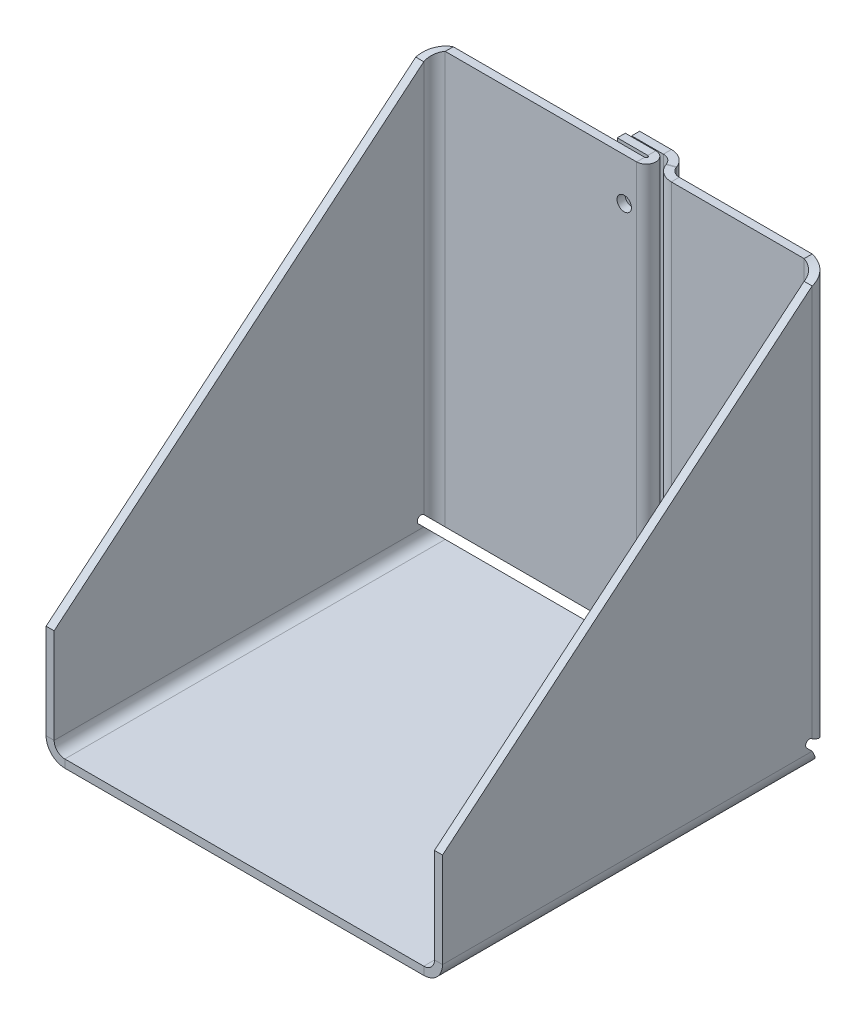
ISO-10303-21;
HEADER;
FILE_DESCRIPTION(('STEP AP214'),'2;1');
FILE_NAME('part.step','',(''),(''),'','','');
FILE_SCHEMA(('AUTOMOTIVE_DESIGN { 1 0 10303 214 1 1 1 1 }'));
ENDSEC;
DATA;
#1=APPLICATION_CONTEXT('core data for automotive mechanical design processes');
#2=APPLICATION_PROTOCOL_DEFINITION('international standard','automotive_design',2000,#1);
#3=PRODUCT_CONTEXT('',#1,'mechanical');
#4=PRODUCT('Part','Part','',(#3));
#5=PRODUCT_RELATED_PRODUCT_CATEGORY('part','',(#4));
#6=PRODUCT_DEFINITION_FORMATION('','',#4);
#7=PRODUCT_DEFINITION_CONTEXT('part definition',#1,'design');
#8=PRODUCT_DEFINITION('design','',#6,#7);
#9=PRODUCT_DEFINITION_SHAPE('','',#8);
#10=(LENGTH_UNIT() NAMED_UNIT(*) SI_UNIT(.MILLI.,.METRE.));
#11=(NAMED_UNIT(*) PLANE_ANGLE_UNIT() SI_UNIT($,.RADIAN.));
#12=(NAMED_UNIT(*) SI_UNIT($,.STERADIAN.) SOLID_ANGLE_UNIT());
#13=UNCERTAINTY_MEASURE_WITH_UNIT(LENGTH_MEASURE(1.E-05),#10,'distance_accuracy_value','');
#14=(GEOMETRIC_REPRESENTATION_CONTEXT(3) GLOBAL_UNCERTAINTY_ASSIGNED_CONTEXT((#13)) GLOBAL_UNIT_ASSIGNED_CONTEXT((#10,
#11,#12)) REPRESENTATION_CONTEXT('',''));
#15=CARTESIAN_POINT('',(0.,0.,0.));
#16=DIRECTION('',(0.,0.,1.));
#17=DIRECTION('',(1.,0.,0.));
#18=AXIS2_PLACEMENT_3D('',#15,#16,#17);
#19=CARTESIAN_POINT('',(-45.,100.,90.));
#20=DIRECTION('',(1.,0.,0.));
#21=DIRECTION('',(0.,1.,0.));
#22=AXIS2_PLACEMENT_3D('',#19,#20,#21);
#23=PLANE('',#22);
#24=DIRECTION('',(0.,0.,-1.));
#25=VECTOR('',#24,1.);
#26=CARTESIAN_POINT('',(-45.,2.54,90.));
#27=LINE('',#26,#25);
#28=CARTESIAN_POINT('',(-45.,2.54,90.));
#29=VERTEX_POINT('',#28);
#30=CARTESIAN_POINT('',(-45.,2.54,2.54000000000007));
#31=VERTEX_POINT('',#30);
#32=EDGE_CURVE('E698',#29,#31,#27,.T.);
#33=ORIENTED_EDGE('',*,*,#32,.T.);
#34=DIRECTION('',(0.,0.707106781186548,0.707106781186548));
#35=VECTOR('',#34,1.);
#36=CARTESIAN_POINT('',(-45.,0.,0.));
#37=LINE('',#36,#35);
#38=CARTESIAN_POINT('',(-45.,3.81000000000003,3.81000000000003));
#39=VERTEX_POINT('',#38);
#40=EDGE_CURVE('E418',#39,#31,#37,.F.);
#41=ORIENTED_EDGE('',*,*,#40,.F.);
#42=CARTESIAN_POINT('',(-45.,4.44500000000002,3.17500000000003));
#43=DIRECTION('',(1.,0.,0.));
#44=DIRECTION('',(0.,1.,0.));
#45=AXIS2_PLACEMENT_3D('',#42,#43,#44);
#46=CIRCLE('',#45,0.898025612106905);
#47=CARTESIAN_POINT('',(-45.,5.08000000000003,2.54000000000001));
#48=VERTEX_POINT('',#47);
#49=EDGE_CURVE('E413',#48,#39,#46,.T.);
#50=ORIENTED_EDGE('',*,*,#49,.F.);
#51=DIRECTION('',(0.,1.,0.));
#52=VECTOR('',#51,1.);
#53=CARTESIAN_POINT('',(-45.,100.,2.54000000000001));
#54=LINE('',#53,#52);
#55=CARTESIAN_POINT('',(-45.,97.8833333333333,2.54000000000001));
#56=VERTEX_POINT('',#55);
#57=EDGE_CURVE('E557',#56,#48,#54,.F.);
#58=ORIENTED_EDGE('',*,*,#57,.F.);
#59=DIRECTION('',(0.,0.64018439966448,-0.768221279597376));
#60=VECTOR('',#59,1.);
#61=CARTESIAN_POINT('',(-45.,55.7377049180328,53.1147540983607));
#62=LINE('',#61,#60);
#63=CARTESIAN_POINT('',(-45.,25.,90.));
#64=VERTEX_POINT('',#63);
#65=EDGE_CURVE('E689',#64,#56,#62,.T.);
#66=ORIENTED_EDGE('',*,*,#65,.F.);
#67=DIRECTION('',(0.,-1.,0.));
#68=VECTOR('',#67,1.);
#69=CARTESIAN_POINT('',(-45.,100.,90.));
#70=LINE('',#69,#68);
#71=EDGE_CURVE('E716',#64,#29,#70,.T.);
#72=ORIENTED_EDGE('',*,*,#71,.T.);
#73=EDGE_LOOP('',(#33,#41,#50,#58,#66,#72));
#74=FACE_BOUND('',#73,.T.);
#75=ADVANCED_FACE('F78',(#74),#23,.T.);
#76=CARTESIAN_POINT('',(-46.89738,100.,90.));
#77=DIRECTION('',(1.,0.,0.));
#78=DIRECTION('',(0.,1.,0.));
#79=AXIS2_PLACEMENT_3D('',#76,#77,#78);
#80=PLANE('',#79);
#81=DIRECTION('',(0.,1.,0.));
#82=VECTOR('',#81,1.);
#83=CARTESIAN_POINT('',(-46.89738,100.,2.54000000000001));
#84=LINE('',#83,#82);
#85=CARTESIAN_POINT('',(-46.89738,97.8833333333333,2.54));
#86=VERTEX_POINT('',#85);
#87=CARTESIAN_POINT('',(-46.89738,5.08000000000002,2.54000000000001));
#88=VERTEX_POINT('',#87);
#89=EDGE_CURVE('E553',#86,#88,#84,.F.);
#90=ORIENTED_EDGE('',*,*,#89,.T.);
#91=CARTESIAN_POINT('',(-46.89738,4.44500000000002,3.17500000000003));
#92=DIRECTION('',(1.,0.,0.));
#93=DIRECTION('',(0.,1.,0.));
#94=AXIS2_PLACEMENT_3D('',#91,#92,#93);
#95=CIRCLE('',#94,0.898025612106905);
#96=CARTESIAN_POINT('',(-46.89738,3.81000000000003,3.81000000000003));
#97=VERTEX_POINT('',#96);
#98=EDGE_CURVE('E412',#88,#97,#95,.T.);
#99=ORIENTED_EDGE('',*,*,#98,.T.);
#100=DIRECTION('',(0.,0.707106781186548,0.707106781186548));
#101=VECTOR('',#100,1.);
#102=CARTESIAN_POINT('',(-46.89738,0.,0.));
#103=LINE('',#102,#101);
#104=CARTESIAN_POINT('',(-46.89738,2.54,2.54000000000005));
#105=VERTEX_POINT('',#104);
#106=EDGE_CURVE('E427',#97,#105,#103,.F.);
#107=ORIENTED_EDGE('',*,*,#106,.T.);
#108=DIRECTION('',(0.,0.,-1.));
#109=VECTOR('',#108,1.);
#110=CARTESIAN_POINT('',(-46.89738,2.54,90.));
#111=LINE('',#110,#109);
#112=CARTESIAN_POINT('',(-46.89738,2.54,90.));
#113=VERTEX_POINT('',#112);
#114=EDGE_CURVE('E739',#113,#105,#111,.T.);
#115=ORIENTED_EDGE('',*,*,#114,.F.);
#116=DIRECTION('',(0.,-1.,0.));
#117=VECTOR('',#116,1.);
#118=CARTESIAN_POINT('',(-46.89738,100.,90.));
#119=LINE('',#118,#117);
#120=CARTESIAN_POINT('',(-46.89738,25.,90.));
#121=VERTEX_POINT('',#120);
#122=EDGE_CURVE('E697',#121,#113,#119,.T.);
#123=ORIENTED_EDGE('',*,*,#122,.F.);
#124=DIRECTION('',(0.,0.64018439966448,-0.768221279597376));
#125=VECTOR('',#124,1.);
#126=CARTESIAN_POINT('',(-46.89738,55.7377049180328,53.1147540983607));
#127=LINE('',#126,#125);
#128=EDGE_CURVE('E694',#121,#86,#127,.T.);
#129=ORIENTED_EDGE('',*,*,#128,.T.);
#130=EDGE_LOOP('',(#90,#99,#107,#115,#123,#129));
#131=FACE_BOUND('',#130,.T.);
#132=ADVANCED_FACE('F600',(#131),#80,.F.);
#133=CARTESIAN_POINT('',(-46.89738,55.7377049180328,53.1147540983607));
#134=DIRECTION('',(0.,-0.768221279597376,-0.64018439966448));
#135=DIRECTION('',(0.,0.64018439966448,-0.768221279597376));
#136=AXIS2_PLACEMENT_3D('',#133,#134,#135);
#137=PLANE('',#136);
#138=ORIENTED_EDGE('',*,*,#65,.T.);
#139=DIRECTION('',(-1.,0.,0.));
#140=VECTOR('',#139,1.);
#141=CARTESIAN_POINT('',(-45.,97.8833333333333,2.54000000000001));
#142=LINE('',#141,#140);
#143=EDGE_CURVE('E104',#56,#86,#142,.T.);
#144=ORIENTED_EDGE('',*,*,#143,.T.);
#145=ORIENTED_EDGE('',*,*,#128,.F.);
#146=DIRECTION('',(-1.,0.,0.));
#147=VECTOR('',#146,1.);
#148=CARTESIAN_POINT('',(-46.89738,25.,90.));
#149=LINE('',#148,#147);
#150=EDGE_CURVE('E693',#121,#64,#149,.F.);
#151=ORIENTED_EDGE('',*,*,#150,.T.);
#152=EDGE_LOOP('',(#138,#144,#145,#151));
#153=FACE_BOUND('',#152,.T.);
#154=ADVANCED_FACE('F606',(#153),#137,.F.);
#155=CARTESIAN_POINT('',(45.,2.54,-1.89738));
#156=DIRECTION('',(0.,-1.,0.));
#157=DIRECTION('',(0.,0.,-1.));
#158=AXIS2_PLACEMENT_3D('',#155,#156,#157);
#159=PLANE('',#158);
#160=DIRECTION('',(1.,0.,0.));
#161=VECTOR('',#160,1.);
#162=CARTESIAN_POINT('',(45.,2.54,-1.89738));
#163=LINE('',#162,#161);
#164=CARTESIAN_POINT('',(11.028499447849,2.54000000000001,-1.89738000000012));
#165=VERTEX_POINT('',#164);
#166=CARTESIAN_POINT('',(42.46,2.54,-1.89737999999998));
#167=VERTEX_POINT('',#166);
#168=EDGE_CURVE('E777',#165,#167,#163,.T.);
#169=ORIENTED_EDGE('',*,*,#168,.T.);
#170=DIRECTION('',(0.,0.,1.));
#171=VECTOR('',#170,1.);
#172=CARTESIAN_POINT('',(42.46,2.54,-1.89737999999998));
#173=LINE('',#172,#171);
#174=CARTESIAN_POINT('',(42.46,2.54,0.));
#175=VERTEX_POINT('',#174);
#176=EDGE_CURVE('E402',#167,#175,#173,.T.);
#177=ORIENTED_EDGE('',*,*,#176,.T.);
#178=DIRECTION('',(1.,0.,0.));
#179=VECTOR('',#178,1.);
#180=CARTESIAN_POINT('',(45.,2.54,0.));
#181=LINE('',#180,#179);
#182=CARTESIAN_POINT('',(11.028499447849,2.54000000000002,-1.20563281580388E-13));
#183=VERTEX_POINT('',#182);
#184=EDGE_CURVE('E909',#183,#175,#181,.T.);
#185=ORIENTED_EDGE('',*,*,#184,.F.);
#186=DIRECTION('',(0.,0.,-1.));
#187=VECTOR('',#186,1.);
#188=CARTESIAN_POINT('',(11.028499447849,2.54000000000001,-1.89738));
#189=LINE('',#188,#187);
#190=EDGE_CURVE('E899',#183,#165,#189,.T.);
#191=ORIENTED_EDGE('',*,*,#190,.T.);
#192=EDGE_LOOP('',(#169,#177,#185,#191));
#193=FACE_BOUND('',#192,.T.);
#194=ADVANCED_FACE('F634',(#193),#159,.T.);
#195=CARTESIAN_POINT('',(-3.10262,100.,-1.89738000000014));
#196=DIRECTION('',(0.,1.,0.));
#197=DIRECTION('',(0.,0.,1.));
#198=AXIS2_PLACEMENT_3D('',#195,#196,#197);
#199=PLANE('',#198);
#200=DIRECTION('',(-1.,0.,0.));
#201=VECTOR('',#200,1.);
#202=CARTESIAN_POINT('',(-3.10262,100.,-1.89738000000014));
#203=LINE('',#202,#201);
#204=CARTESIAN_POINT('',(42.46,100.,-1.89737999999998));
#205=VERTEX_POINT('',#204);
#206=CARTESIAN_POINT('',(11.028499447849,100.,-1.89738000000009));
#207=VERTEX_POINT('',#206);
#208=EDGE_CURVE('E1263',#205,#207,#203,.T.);
#209=ORIENTED_EDGE('',*,*,#208,.T.);
#210=DIRECTION('',(0.,0.,1.));
#211=VECTOR('',#210,1.);
#212=CARTESIAN_POINT('',(11.028499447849,100.,-1.89738000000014));
#213=LINE('',#212,#211);
#214=CARTESIAN_POINT('',(11.028499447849,100.,0.));
#215=VERTEX_POINT('',#214);
#216=EDGE_CURVE('E1255',#207,#215,#213,.T.);
#217=ORIENTED_EDGE('',*,*,#216,.T.);
#218=DIRECTION('',(-1.,0.,0.));
#219=VECTOR('',#218,1.);
#220=CARTESIAN_POINT('',(-3.10262000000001,100.,-1.40193824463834E-13));
#221=LINE('',#220,#219);
#222=CARTESIAN_POINT('',(42.46,100.,0.));
#223=VERTEX_POINT('',#222);
#224=EDGE_CURVE('E1245',#223,#215,#221,.T.);
#225=ORIENTED_EDGE('',*,*,#224,.F.);
#226=DIRECTION('',(0.,0.,-1.));
#227=VECTOR('',#226,1.);
#228=CARTESIAN_POINT('',(42.46,100.,0.));
#229=LINE('',#228,#227);
#230=EDGE_CURVE('E1236',#223,#205,#229,.T.);
#231=ORIENTED_EDGE('',*,*,#230,.T.);
#232=EDGE_LOOP('',(#209,#217,#225,#231));
#233=FACE_BOUND('',#232,.T.);
#234=ADVANCED_FACE('F1253',(#233),#199,.T.);
#235=CARTESIAN_POINT('',(0.,0.,-1.89738000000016));
#236=DIRECTION('',(0.,0.,-1.));
#237=DIRECTION('',(-1.,0.,0.));
#238=AXIS2_PLACEMENT_3D('',#235,#236,#237);
#239=PLANE('',#238);
#240=DIRECTION('',(0.,-1.,0.));
#241=VECTOR('',#240,1.);
#242=CARTESIAN_POINT('',(42.46,0.,-1.89738000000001));
#243=LINE('',#242,#241);
#244=EDGE_CURVE('E1261',#205,#167,#243,.T.);
#245=ORIENTED_EDGE('',*,*,#244,.T.);
#246=ORIENTED_EDGE('',*,*,#168,.F.);
#247=DIRECTION('',(0.,1.,0.));
#248=VECTOR('',#247,1.);
#249=CARTESIAN_POINT('',(11.028499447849,0.,-1.89738000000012));
#250=LINE('',#249,#248);
#251=EDGE_CURVE('E906',#165,#207,#250,.T.);
#252=ORIENTED_EDGE('',*,*,#251,.T.);
#253=ORIENTED_EDGE('',*,*,#208,.F.);
#254=EDGE_LOOP('',(#245,#246,#252,#253));
#255=FACE_BOUND('',#254,.T.);
#256=ADVANCED_FACE('F1290',(#255),#239,.T.);
#257=CARTESIAN_POINT('',(0.,0.,-1.57840025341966E-13));
#258=DIRECTION('',(0.,0.,-1.));
#259=DIRECTION('',(-1.,0.,0.));
#260=AXIS2_PLACEMENT_3D('',#257,#258,#259);
#261=PLANE('',#260);
#262=ORIENTED_EDGE('',*,*,#184,.T.);
#263=DIRECTION('',(0.,-1.,0.));
#264=VECTOR('',#263,1.);
#265=CARTESIAN_POINT('',(42.46,100.,0.));
#266=LINE('',#265,#264);
#267=EDGE_CURVE('E672',#223,#175,#266,.T.);
#268=ORIENTED_EDGE('',*,*,#267,.F.);
#269=ORIENTED_EDGE('',*,*,#224,.T.);
#270=DIRECTION('',(0.,1.,0.));
#271=VECTOR('',#270,1.);
#272=CARTESIAN_POINT('',(11.028499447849,0.,-1.1933422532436E-13));
#273=LINE('',#272,#271);
#274=EDGE_CURVE('E1249',#183,#215,#273,.T.);
#275=ORIENTED_EDGE('',*,*,#274,.F.);
#276=EDGE_LOOP('',(#262,#268,#269,#275));
#277=FACE_BOUND('',#276,.T.);
#278=ADVANCED_FACE('F1204',(#277),#261,.F.);
#279=CARTESIAN_POINT('',(46.89738,0.,90.));
#280=DIRECTION('',(-1.,0.,0.));
#281=DIRECTION('',(0.,-1.,0.));
#282=AXIS2_PLACEMENT_3D('',#279,#280,#281);
#283=PLANE('',#282);
#284=DIRECTION('',(0.,0.,-1.));
#285=VECTOR('',#284,1.);
#286=CARTESIAN_POINT('',(46.89738,2.54,90.));
#287=LINE('',#286,#285);
#288=CARTESIAN_POINT('',(46.89738,2.54,90.));
#289=VERTEX_POINT('',#288);
#290=CARTESIAN_POINT('',(46.89738,2.54,2.54000000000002));
#291=VERTEX_POINT('',#290);
#292=EDGE_CURVE('E682',#289,#291,#287,.T.);
#293=ORIENTED_EDGE('',*,*,#292,.T.);
#294=DIRECTION('',(0.,0.707106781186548,0.707106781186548));
#295=VECTOR('',#294,1.);
#296=CARTESIAN_POINT('',(46.89738,0.,0.));
#297=LINE('',#296,#295);
#298=CARTESIAN_POINT('',(46.89738,3.80999999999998,3.81000000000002));
#299=VERTEX_POINT('',#298);
#300=EDGE_CURVE('E372',#299,#291,#297,.F.);
#301=ORIENTED_EDGE('',*,*,#300,.F.);
#302=CARTESIAN_POINT('',(46.89738,4.44499999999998,3.17500000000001));
#303=DIRECTION('',(1.,0.,0.));
#304=DIRECTION('',(0.,1.,0.));
#305=AXIS2_PLACEMENT_3D('',#302,#303,#304);
#306=CIRCLE('',#305,0.898025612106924);
#307=CARTESIAN_POINT('',(46.89738,5.07999999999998,2.54000000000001));
#308=VERTEX_POINT('',#307);
#309=EDGE_CURVE('E383',#308,#299,#306,.T.);
#310=ORIENTED_EDGE('',*,*,#309,.F.);
#311=DIRECTION('',(0.,-1.,0.));
#312=VECTOR('',#311,1.);
#313=CARTESIAN_POINT('',(46.89738,2.54,2.54000000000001));
#314=LINE('',#313,#312);
#315=CARTESIAN_POINT('',(46.89738,97.8833333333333,2.54000000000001));
#316=VERTEX_POINT('',#315);
#317=EDGE_CURVE('E683',#308,#316,#314,.F.);
#318=ORIENTED_EDGE('',*,*,#317,.T.);
#319=DIRECTION('',(0.,-0.64018439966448,0.768221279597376));
#320=VECTOR('',#319,1.);
#321=CARTESIAN_POINT('',(46.89738,14.7540983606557,102.295081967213));
#322=LINE('',#321,#320);
#323=CARTESIAN_POINT('',(46.89738,25.,90.));
#324=VERTEX_POINT('',#323);
#325=EDGE_CURVE('E679',#316,#324,#322,.T.);
#326=ORIENTED_EDGE('',*,*,#325,.T.);
#327=DIRECTION('',(0.,1.,0.));
#328=VECTOR('',#327,1.);
#329=CARTESIAN_POINT('',(46.89738,0.,90.));
#330=LINE('',#329,#328);
#331=EDGE_CURVE('E677',#289,#324,#330,.T.);
#332=ORIENTED_EDGE('',*,*,#331,.F.);
#333=EDGE_LOOP('',(#293,#301,#310,#318,#326,#332));
#334=FACE_BOUND('',#333,.T.);
#335=ADVANCED_FACE('F1201',(#334),#283,.F.);
#336=CARTESIAN_POINT('',(45.,0.,90.));
#337=DIRECTION('',(-1.,0.,0.));
#338=DIRECTION('',(0.,-1.,0.));
#339=AXIS2_PLACEMENT_3D('',#336,#337,#338);
#340=PLANE('',#339);
#341=DIRECTION('',(0.,0.707106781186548,0.707106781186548));
#342=VECTOR('',#341,1.);
#343=CARTESIAN_POINT('',(45.,0.,0.));
#344=LINE('',#343,#342);
#345=CARTESIAN_POINT('',(45.,3.80999999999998,3.81000000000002));
#346=VERTEX_POINT('',#345);
#347=CARTESIAN_POINT('',(45.,2.54,2.54000000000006));
#348=VERTEX_POINT('',#347);
#349=EDGE_CURVE('E356',#346,#348,#344,.F.);
#350=ORIENTED_EDGE('',*,*,#349,.T.);
#351=DIRECTION('',(0.,0.,-1.));
#352=VECTOR('',#351,1.);
#353=CARTESIAN_POINT('',(45.,2.54,90.));
#354=LINE('',#353,#352);
#355=CARTESIAN_POINT('',(45.,2.54,90.));
#356=VERTEX_POINT('',#355);
#357=EDGE_CURVE('E360',#356,#348,#354,.T.);
#358=ORIENTED_EDGE('',*,*,#357,.F.);
#359=DIRECTION('',(0.,1.,0.));
#360=VECTOR('',#359,1.);
#361=CARTESIAN_POINT('',(45.,0.,90.));
#362=LINE('',#361,#360);
#363=CARTESIAN_POINT('',(45.,25.,90.));
#364=VERTEX_POINT('',#363);
#365=EDGE_CURVE('E678',#356,#364,#362,.T.);
#366=ORIENTED_EDGE('',*,*,#365,.T.);
#367=DIRECTION('',(0.,-0.64018439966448,0.768221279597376));
#368=VECTOR('',#367,1.);
#369=CARTESIAN_POINT('',(45.,14.7540983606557,102.295081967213));
#370=LINE('',#369,#368);
#371=CARTESIAN_POINT('',(45.,97.8833333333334,2.53999999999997));
#372=VERTEX_POINT('',#371);
#373=EDGE_CURVE('E674',#372,#364,#370,.T.);
#374=ORIENTED_EDGE('',*,*,#373,.F.);
#375=DIRECTION('',(0.,-1.,0.));
#376=VECTOR('',#375,1.);
#377=CARTESIAN_POINT('',(45.,2.54,2.54000000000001));
#378=LINE('',#377,#376);
#379=CARTESIAN_POINT('',(45.,5.07999999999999,2.54000000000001));
#380=VERTEX_POINT('',#379);
#381=EDGE_CURVE('E673',#380,#372,#378,.F.);
#382=ORIENTED_EDGE('',*,*,#381,.F.);
#383=CARTESIAN_POINT('',(45.,4.44499999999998,3.17500000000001));
#384=DIRECTION('',(1.,0.,0.));
#385=DIRECTION('',(0.,1.,0.));
#386=AXIS2_PLACEMENT_3D('',#383,#384,#385);
#387=CIRCLE('',#386,0.898025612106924);
#388=EDGE_CURVE('E363',#380,#346,#387,.T.);
#389=ORIENTED_EDGE('',*,*,#388,.T.);
#390=EDGE_LOOP('',(#350,#358,#366,#374,#382,#389));
#391=FACE_BOUND('',#390,.T.);
#392=ADVANCED_FACE('F638',(#391),#340,.T.);
#393=CARTESIAN_POINT('',(46.89738,14.7540983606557,102.295081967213));
#394=DIRECTION('',(0.,-0.768221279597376,-0.64018439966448));
#395=DIRECTION('',(0.,-0.64018439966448,0.768221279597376));
#396=AXIS2_PLACEMENT_3D('',#393,#394,#395);
#397=PLANE('',#396);
#398=ORIENTED_EDGE('',*,*,#325,.F.);
#399=DIRECTION('',(1.,0.,0.));
#400=VECTOR('',#399,1.);
#401=CARTESIAN_POINT('',(45.,97.8833333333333,2.54000000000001));
#402=LINE('',#401,#400);
#403=EDGE_CURVE('E692',#372,#316,#402,.T.);
#404=ORIENTED_EDGE('',*,*,#403,.F.);
#405=ORIENTED_EDGE('',*,*,#373,.T.);
#406=DIRECTION('',(1.,0.,0.));
#407=VECTOR('',#406,1.);
#408=CARTESIAN_POINT('',(46.89738,25.,90.));
#409=LINE('',#408,#407);
#410=EDGE_CURVE('E684',#324,#364,#409,.F.);
#411=ORIENTED_EDGE('',*,*,#410,.F.);
#412=EDGE_LOOP('',(#398,#404,#405,#411));
#413=FACE_BOUND('',#412,.T.);
#414=ADVANCED_FACE('F635',(#413),#397,.F.);
#415=CARTESIAN_POINT('',(42.4599999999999,-1.89738,90.));
#416=DIRECTION('',(0.,0.,1.));
#417=DIRECTION('',(1.,0.,0.));
#418=AXIS2_PLACEMENT_3D('',#415,#416,#417);
#419=PLANE('',#418);
#420=ORIENTED_EDGE('',*,*,#331,.T.);
#421=ORIENTED_EDGE('',*,*,#410,.T.);
#422=ORIENTED_EDGE('',*,*,#365,.F.);
#423=DIRECTION('',(1.,0.,0.));
#424=VECTOR('',#423,1.);
#425=CARTESIAN_POINT('',(45.,2.54,90.));
#426=LINE('',#425,#424);
#427=EDGE_CURVE('E688',#356,#289,#426,.T.);
#428=ORIENTED_EDGE('',*,*,#427,.T.);
#429=EDGE_LOOP('',(#420,#421,#422,#428));
#430=FACE_BOUND('',#429,.T.);
#431=ADVANCED_FACE('F630',(#430),#419,.T.);
#432=CARTESIAN_POINT('',(42.46,2.54,90.));
#433=DIRECTION('',(0.,0.,-1.));
#434=DIRECTION('',(-1.,0.,0.));
#435=AXIS2_PLACEMENT_3D('',#432,#433,#434);
#436=PLANE('',#435);
#437=ORIENTED_EDGE('',*,*,#150,.F.);
#438=ORIENTED_EDGE('',*,*,#122,.T.);
#439=DIRECTION('',(1.,0.,0.));
#440=VECTOR('',#439,1.);
#441=CARTESIAN_POINT('',(-46.89738,2.54,90.));
#442=LINE('',#441,#440);
#443=EDGE_CURVE('E721',#113,#29,#442,.T.);
#444=ORIENTED_EDGE('',*,*,#443,.T.);
#445=ORIENTED_EDGE('',*,*,#71,.F.);
#446=EDGE_LOOP('',(#437,#438,#444,#445));
#447=FACE_BOUND('',#446,.T.);
#448=ADVANCED_FACE('F626',(#447),#436,.F.);
#449=CARTESIAN_POINT('',(-42.46,0.,90.));
#450=DIRECTION('',(0.,0.,1.));
#451=DIRECTION('',(1.,0.,0.));
#452=AXIS2_PLACEMENT_3D('',#449,#450,#451);
#453=PLANE('',#452);
#454=DIRECTION('',(0.,-1.,0.));
#455=VECTOR('',#454,1.);
#456=CARTESIAN_POINT('',(-42.46,0.,90.));
#457=LINE('',#456,#455);
#458=CARTESIAN_POINT('',(-42.46,0.,90.));
#459=VERTEX_POINT('',#458);
#460=CARTESIAN_POINT('',(-42.46,-1.89738,90.));
#461=VERTEX_POINT('',#460);
#462=EDGE_CURVE('E726',#459,#461,#457,.T.);
#463=ORIENTED_EDGE('',*,*,#462,.F.);
#464=CARTESIAN_POINT('',(-42.46,2.54,90.));
#465=DIRECTION('',(0.,0.,-1.));
#466=DIRECTION('',(-1.,0.,0.));
#467=AXIS2_PLACEMENT_3D('',#464,#465,#466);
#468=CIRCLE('',#467,2.54);
#469=EDGE_CURVE('E344',#29,#459,#468,.F.);
#470=ORIENTED_EDGE('',*,*,#469,.F.);
#471=ORIENTED_EDGE('',*,*,#443,.F.);
#472=CARTESIAN_POINT('',(-42.46,2.54,90.));
#473=DIRECTION('',(0.,0.,1.));
#474=DIRECTION('',(1.,0.,0.));
#475=AXIS2_PLACEMENT_3D('',#472,#473,#474);
#476=CIRCLE('',#475,4.43738);
#477=EDGE_CURVE('E722',#113,#461,#476,.T.);
#478=ORIENTED_EDGE('',*,*,#477,.T.);
#479=EDGE_LOOP('',(#463,#470,#471,#478));
#480=FACE_BOUND('',#479,.T.);
#481=ADVANCED_FACE('F629',(#480),#453,.T.);
#482=CARTESIAN_POINT('',(-46.89738,2.54,90.));
#483=DIRECTION('',(0.,0.,1.));
#484=DIRECTION('',(1.,0.,0.));
#485=AXIS2_PLACEMENT_3D('',#482,#483,#484);
#486=PLANE('',#485);
#487=DIRECTION('',(1.,0.,0.));
#488=VECTOR('',#487,1.);
#489=CARTESIAN_POINT('',(-45.,0.,90.));
#490=LINE('',#489,#488);
#491=CARTESIAN_POINT('',(42.4599999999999,0.,90.));
#492=VERTEX_POINT('',#491);
#493=EDGE_CURVE('E338',#459,#492,#490,.T.);
#494=ORIENTED_EDGE('',*,*,#493,.F.);
#495=ORIENTED_EDGE('',*,*,#462,.T.);
#496=DIRECTION('',(1.,0.,0.));
#497=VECTOR('',#496,1.);
#498=CARTESIAN_POINT('',(-45.,-1.89738,90.));
#499=LINE('',#498,#497);
#500=CARTESIAN_POINT('',(42.4599999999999,-1.89738,90.));
#501=VERTEX_POINT('',#500);
#502=EDGE_CURVE('E727',#461,#501,#499,.T.);
#503=ORIENTED_EDGE('',*,*,#502,.T.);
#504=DIRECTION('',(0.,1.,0.));
#505=VECTOR('',#504,1.);
#506=CARTESIAN_POINT('',(42.4599999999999,-1.89738,90.));
#507=LINE('',#506,#505);
#508=EDGE_CURVE('E731',#501,#492,#507,.T.);
#509=ORIENTED_EDGE('',*,*,#508,.T.);
#510=EDGE_LOOP('',(#494,#495,#503,#509));
#511=FACE_BOUND('',#510,.T.);
#512=ADVANCED_FACE('F1187',(#511),#486,.T.);
#513=CARTESIAN_POINT('',(45.,2.54,90.));
#514=DIRECTION('',(0.,0.,1.));
#515=DIRECTION('',(1.,0.,0.));
#516=AXIS2_PLACEMENT_3D('',#513,#514,#515);
#517=PLANE('',#516);
#518=ORIENTED_EDGE('',*,*,#427,.F.);
#519=CARTESIAN_POINT('',(42.46,2.54,90.));
#520=DIRECTION('',(0.,0.,-1.));
#521=DIRECTION('',(-1.,0.,0.));
#522=AXIS2_PLACEMENT_3D('',#519,#520,#521);
#523=CIRCLE('',#522,2.54);
#524=EDGE_CURVE('E330',#492,#356,#523,.F.);
#525=ORIENTED_EDGE('',*,*,#524,.F.);
#526=ORIENTED_EDGE('',*,*,#508,.F.);
#527=CARTESIAN_POINT('',(42.46,2.54,90.));
#528=DIRECTION('',(0.,0.,1.));
#529=DIRECTION('',(1.,0.,0.));
#530=AXIS2_PLACEMENT_3D('',#527,#528,#529);
#531=CIRCLE('',#530,4.43738);
#532=EDGE_CURVE('E331',#501,#289,#531,.T.);
#533=ORIENTED_EDGE('',*,*,#532,.T.);
#534=EDGE_LOOP('',(#518,#525,#526,#533));
#535=FACE_BOUND('',#534,.T.);
#536=ADVANCED_FACE('F1191',(#535),#517,.T.);
#537=CARTESIAN_POINT('',(46.89738,2.54,0.));
#538=DIRECTION('',(0.,0.,-1.));
#539=DIRECTION('',(-1.,0.,0.));
#540=AXIS2_PLACEMENT_3D('',#537,#538,#539);
#541=PLANE('',#540);
#542=DIRECTION('',(1.,0.,0.));
#543=VECTOR('',#542,1.);
#544=CARTESIAN_POINT('',(-45.,0.,0.));
#545=LINE('',#544,#543);
#546=CARTESIAN_POINT('',(-42.46,0.,0.));
#547=VERTEX_POINT('',#546);
#548=CARTESIAN_POINT('',(42.46,0.,0.));
#549=VERTEX_POINT('',#548);
#550=EDGE_CURVE('E317',#547,#549,#545,.T.);
#551=ORIENTED_EDGE('',*,*,#550,.T.);
#552=DIRECTION('',(0.,1.,0.));
#553=VECTOR('',#552,1.);
#554=CARTESIAN_POINT('',(42.4599999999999,-1.89738,0.));
#555=LINE('',#554,#553);
#556=CARTESIAN_POINT('',(42.4599999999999,-1.89738,0.));
#557=VERTEX_POINT('',#556);
#558=EDGE_CURVE('E322',#557,#549,#555,.T.);
#559=ORIENTED_EDGE('',*,*,#558,.F.);
#560=DIRECTION('',(1.,0.,0.));
#561=VECTOR('',#560,1.);
#562=CARTESIAN_POINT('',(-45.,-1.89738,0.));
#563=LINE('',#562,#561);
#564=CARTESIAN_POINT('',(-42.46,-1.89738,0.));
#565=VERTEX_POINT('',#564);
#566=EDGE_CURVE('E735',#565,#557,#563,.T.);
#567=ORIENTED_EDGE('',*,*,#566,.F.);
#568=DIRECTION('',(0.,1.,0.));
#569=VECTOR('',#568,1.);
#570=CARTESIAN_POINT('',(-42.46,-1.89738,0.));
#571=LINE('',#570,#569);
#572=EDGE_CURVE('E325',#565,#547,#571,.T.);
#573=ORIENTED_EDGE('',*,*,#572,.T.);
#574=EDGE_LOOP('',(#551,#559,#567,#573));
#575=FACE_BOUND('',#574,.T.);
#576=ADVANCED_FACE('F319',(#575),#541,.T.);
#577=CARTESIAN_POINT('',(42.46,2.54,90.));
#578=DIRECTION('',(0.,0.,-1.));
#579=DIRECTION('',(-1.,0.,0.));
#580=AXIS2_PLACEMENT_3D('',#577,#578,#579);
#581=CYLINDRICAL_SURFACE('',#580,2.54);
#582=ORIENTED_EDGE('',*,*,#357,.T.);
#583=CARTESIAN_POINT('',(42.46,2.54,2.54000000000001));
#584=DIRECTION('',(0.,0.707106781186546,-0.707106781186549));
#585=DIRECTION('',(0.,-0.707106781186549,-0.707106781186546));
#586=AXIS2_PLACEMENT_3D('',#583,#584,#585);
#587=ELLIPSE('',#586,3.59210244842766,2.53999999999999);
#588=EDGE_CURVE('E350',#549,#348,#587,.F.);
#589=ORIENTED_EDGE('',*,*,#588,.F.);
#590=DIRECTION('',(0.,0.,-1.));
#591=VECTOR('',#590,1.);
#592=CARTESIAN_POINT('',(42.4599999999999,0.,90.));
#593=LINE('',#592,#591);
#594=EDGE_CURVE('E335',#492,#549,#593,.T.);
#595=ORIENTED_EDGE('',*,*,#594,.F.);
#596=ORIENTED_EDGE('',*,*,#524,.T.);
#597=EDGE_LOOP('',(#582,#589,#595,#596));
#598=FACE_BOUND('',#597,.T.);
#599=ADVANCED_FACE('F358',(#598),#581,.F.);
#600=CARTESIAN_POINT('',(-45.,0.,90.));
#601=DIRECTION('',(0.,1.,0.));
#602=DIRECTION('',(0.,0.,1.));
#603=AXIS2_PLACEMENT_3D('',#600,#601,#602);
#604=PLANE('',#603);
#605=ORIENTED_EDGE('',*,*,#594,.T.);
#606=ORIENTED_EDGE('',*,*,#550,.F.);
#607=DIRECTION('',(0.,0.,-1.));
#608=VECTOR('',#607,1.);
#609=CARTESIAN_POINT('',(-42.46,0.,90.));
#610=LINE('',#609,#608);
#611=EDGE_CURVE('E715',#459,#547,#610,.T.);
#612=ORIENTED_EDGE('',*,*,#611,.F.);
#613=ORIENTED_EDGE('',*,*,#493,.T.);
#614=EDGE_LOOP('',(#605,#606,#612,#613));
#615=FACE_BOUND('',#614,.T.);
#616=ADVANCED_FACE('F336',(#615),#604,.T.);
#617=CARTESIAN_POINT('',(-42.46,2.54,90.));
#618=DIRECTION('',(0.,0.,-1.));
#619=DIRECTION('',(-1.,0.,0.));
#620=AXIS2_PLACEMENT_3D('',#617,#618,#619);
#621=CYLINDRICAL_SURFACE('',#620,2.54);
#622=ORIENTED_EDGE('',*,*,#611,.T.);
#623=CARTESIAN_POINT('',(-42.46,2.54000000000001,2.54000000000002));
#624=DIRECTION('',(0.,0.707106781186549,-0.707106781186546));
#625=DIRECTION('',(0.,-0.707106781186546,-0.707106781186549));
#626=AXIS2_PLACEMENT_3D('',#623,#624,#625);
#627=ELLIPSE('',#626,3.59210244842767,2.54000000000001);
#628=EDGE_CURVE('E411',#31,#547,#627,.F.);
#629=ORIENTED_EDGE('',*,*,#628,.F.);
#630=ORIENTED_EDGE('',*,*,#32,.F.);
#631=ORIENTED_EDGE('',*,*,#469,.T.);
#632=EDGE_LOOP('',(#622,#629,#630,#631));
#633=FACE_BOUND('',#632,.T.);
#634=ADVANCED_FACE('F610',(#633),#621,.F.);
#635=CARTESIAN_POINT('',(-42.46,2.54,90.));
#636=DIRECTION('',(0.,0.,-1.));
#637=DIRECTION('',(-1.,0.,0.));
#638=AXIS2_PLACEMENT_3D('',#635,#636,#637);
#639=CYLINDRICAL_SURFACE('',#638,4.43738);
#640=ORIENTED_EDGE('',*,*,#114,.T.);
#641=CARTESIAN_POINT('',(-42.46,2.54000000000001,2.54000000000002));
#642=DIRECTION('',(0.,0.496780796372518,-0.867876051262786));
#643=DIRECTION('',(0.,-0.867876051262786,-0.496780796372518));
#644=AXIS2_PLACEMENT_3D('',#641,#642,#643);
#645=ELLIPSE('',#644,5.11291905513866,4.43738000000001);
#646=EDGE_CURVE('E431',#105,#565,#645,.F.);
#647=ORIENTED_EDGE('',*,*,#646,.T.);
#648=DIRECTION('',(0.,0.,-1.));
#649=VECTOR('',#648,1.);
#650=CARTESIAN_POINT('',(-42.46,-1.89738,90.));
#651=LINE('',#650,#649);
#652=EDGE_CURVE('E738',#461,#565,#651,.T.);
#653=ORIENTED_EDGE('',*,*,#652,.F.);
#654=ORIENTED_EDGE('',*,*,#477,.F.);
#655=EDGE_LOOP('',(#640,#647,#653,#654));
#656=FACE_BOUND('',#655,.T.);
#657=ADVANCED_FACE('F613',(#656),#639,.T.);
#658=CARTESIAN_POINT('',(-45.,-1.89738,90.));
#659=DIRECTION('',(0.,1.,0.));
#660=DIRECTION('',(0.,0.,1.));
#661=AXIS2_PLACEMENT_3D('',#658,#659,#660);
#662=PLANE('',#661);
#663=ORIENTED_EDGE('',*,*,#566,.T.);
#664=DIRECTION('',(0.,0.,-1.));
#665=VECTOR('',#664,1.);
#666=CARTESIAN_POINT('',(42.4599999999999,-1.89738,90.));
#667=LINE('',#666,#665);
#668=EDGE_CURVE('E701',#501,#557,#667,.T.);
#669=ORIENTED_EDGE('',*,*,#668,.F.);
#670=ORIENTED_EDGE('',*,*,#502,.F.);
#671=ORIENTED_EDGE('',*,*,#652,.T.);
#672=EDGE_LOOP('',(#663,#669,#670,#671));
#673=FACE_BOUND('',#672,.T.);
#674=ADVANCED_FACE('F616',(#673),#662,.F.);
#675=CARTESIAN_POINT('',(42.46,2.54,90.));
#676=DIRECTION('',(0.,0.,-1.));
#677=DIRECTION('',(-1.,0.,0.));
#678=AXIS2_PLACEMENT_3D('',#675,#676,#677);
#679=CYLINDRICAL_SURFACE('',#678,4.43738);
#680=ORIENTED_EDGE('',*,*,#668,.T.);
#681=CARTESIAN_POINT('',(42.46,2.54,2.54000000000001));
#682=DIRECTION('',(0.,0.496780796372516,-0.867876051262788));
#683=DIRECTION('',(0.,-0.867876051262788,-0.496780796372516));
#684=AXIS2_PLACEMENT_3D('',#681,#682,#683);
#685=ELLIPSE('',#684,5.11291905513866,4.43737999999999);
#686=EDGE_CURVE('E353',#557,#291,#685,.F.);
#687=ORIENTED_EDGE('',*,*,#686,.T.);
#688=ORIENTED_EDGE('',*,*,#292,.F.);
#689=ORIENTED_EDGE('',*,*,#532,.F.);
#690=EDGE_LOOP('',(#680,#687,#688,#689));
#691=FACE_BOUND('',#690,.T.);
#692=ADVANCED_FACE('F620',(#691),#679,.T.);
#693=CARTESIAN_POINT('',(46.9163538,97.8833333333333,2.54000000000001));
#694=CARTESIAN_POINT('',(46.9163538,98.0597513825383,1.95656827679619));
#695=CARTESIAN_POINT('',(46.800366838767,98.2361111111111,1.37355882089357));
#696=CARTESIAN_POINT('',(46.3539012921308,98.5888888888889,0.29569564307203));
#697=CARTESIAN_POINT('',(46.0235983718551,98.7652777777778,-0.198637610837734));
#698=CARTESIAN_POINT('',(45.1986376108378,99.1180555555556,-1.02359837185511));
#699=CARTESIAN_POINT('',(44.704304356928,99.2944444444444,-1.35390129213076));
#700=CARTESIAN_POINT('',(43.6264411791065,99.6472222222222,-1.800366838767));
#701=CARTESIAN_POINT('',(43.0434317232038,99.8235819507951,-1.91635379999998));
#702=CARTESIAN_POINT('',(42.46,100.,-1.91635379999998));
#703=CARTESIAN_POINT('',(46.89738,97.8833333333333,2.54000000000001));
#704=CARTESIAN_POINT('',(46.89738,98.0597513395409,1.95905243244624));
#705=CARTESIAN_POINT('',(46.7818868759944,98.2361111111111,1.37852517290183));
#706=CARTESIAN_POINT('',(46.3373222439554,98.5888888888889,0.305251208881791));
#707=CARTESIAN_POINT('',(46.0084256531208,98.7652777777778,-0.186977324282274));
#708=CARTESIAN_POINT('',(45.1869773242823,99.1180555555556,-1.00842565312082));
#709=CARTESIAN_POINT('',(44.6947487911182,99.2944444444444,-1.3373222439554));
#710=CARTESIAN_POINT('',(43.6214748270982,99.6472222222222,-1.78188687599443));
#711=CARTESIAN_POINT('',(43.0409475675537,99.8235819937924,-1.89737999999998));
#712=CARTESIAN_POINT('',(42.46,100.,-1.89737999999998));
#713=CARTESIAN_POINT('',(45.,97.8833333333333,2.54000000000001));
#714=CARTESIAN_POINT('',(45.,98.0597470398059,2.20746799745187));
#715=CARTESIAN_POINT('',(44.9338905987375,98.2361111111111,1.87516037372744));
#716=CARTESIAN_POINT('',(44.6794174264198,98.5888888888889,1.26080778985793));
#717=CARTESIAN_POINT('',(44.4911537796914,98.7652777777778,0.97905133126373));
#718=CARTESIAN_POINT('',(44.0209486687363,99.1180555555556,0.508846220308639));
#719=CARTESIAN_POINT('',(43.7391922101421,99.2944444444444,0.320582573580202));
#720=CARTESIAN_POINT('',(43.1248396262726,99.6472222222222,0.0661094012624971));
#721=CARTESIAN_POINT('',(42.7925320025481,99.8235862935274,0.));
#722=CARTESIAN_POINT('',(42.46,100.,0.));
#723=CARTESIAN_POINT('',(44.980836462,97.8833333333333,2.54000000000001));
#724=CARTESIAN_POINT('',(44.980836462,98.0597469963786,2.20997699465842));
#725=CARTESIAN_POINT('',(44.9152258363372,98.2361111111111,1.88017638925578));
#726=CARTESIAN_POINT('',(44.6626725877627,98.5888888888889,1.27045891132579));
#727=CARTESIAN_POINT('',(44.4758293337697,98.7652777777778,0.990828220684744));
#728=CARTESIAN_POINT('',(44.0091717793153,99.1180555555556,0.524170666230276));
#729=CARTESIAN_POINT('',(43.7295410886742,99.2944444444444,0.337327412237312));
#730=CARTESIAN_POINT('',(43.1198236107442,99.6472222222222,0.0847741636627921));
#731=CARTESIAN_POINT('',(42.7900230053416,99.8235863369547,0.0191635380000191));
#732=CARTESIAN_POINT('',(42.46,100.,0.0191635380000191));
#733=B_SPLINE_SURFACE_WITH_KNOTS('',1,3,((#693,#694,#695,#696,#697,#698,#699,#700,#701,#702),
(#703,#704,#705,#706,#707,#708,#709,#710,#711,#712),(#713,#714,#715,#716,#717,#718,#719,#720,
#721,#722),(#723,#724,#725,#726,#727,#728,#729,#730,#731,#732)),.UNSPECIFIED.,.F.,.F.,.F.,(2,1,
1,2),(4,2,2,2,4),(-0.01,0.,1.,1.0101),(0.,0.25,0.5,0.75,1.),.UNSPECIFIED.);
#734=CARTESIAN_POINT('',(45.,97.8833333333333,2.54000000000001));
#735=CARTESIAN_POINT('',(45.0000018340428,97.9216626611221,2.46775574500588));
#736=CARTESIAN_POINT('',(44.9969163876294,97.95997719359,2.39553638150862));
#737=CARTESIAN_POINT('',(44.9846105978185,98.0366002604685,2.2516304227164));
#738=CARTESIAN_POINT('',(44.9753910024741,98.0749087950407,2.17994376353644));
#739=CARTESIAN_POINT('',(44.9386039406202,98.1898291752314,1.9664653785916));
#740=CARTESIAN_POINT('',(44.9019081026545,98.2664813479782,1.82616813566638));
#741=CARTESIAN_POINT('',(44.7994146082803,98.4289736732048,1.53754106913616));
#742=CARTESIAN_POINT('',(44.7306574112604,98.51481451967,1.39026224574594));
#743=CARTESIAN_POINT('',(44.566429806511,98.6864765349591,1.11146168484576));
#744=CARTESIAN_POINT('',(44.4709630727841,98.7722977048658,0.979937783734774));
#745=CARTESIAN_POINT('',(44.2567959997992,98.9439465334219,0.737418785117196));
#746=CARTESIAN_POINT('',(44.1380959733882,99.0297741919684,0.626423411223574));
#747=CARTESIAN_POINT('',(43.881692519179,99.2014720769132,0.428938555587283));
#748=CARTESIAN_POINT('',(43.7439787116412,99.2873423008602,0.342462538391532));
#749=CARTESIAN_POINT('',(43.4545683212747,99.4591337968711,0.197204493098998));
#750=CARTESIAN_POINT('',(43.3028621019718,99.5450550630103,0.138441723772));
#751=CARTESIAN_POINT('',(42.9912064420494,99.7167910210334,0.0509206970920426));
#752=CARTESIAN_POINT('',(42.8312735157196,99.8026055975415,0.0221046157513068));
#753=CARTESIAN_POINT('',(42.6353113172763,99.9069276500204,0.00581185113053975));
#754=CARTESIAN_POINT('',(42.6002602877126,99.9255555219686,0.00363150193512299));
#755=CARTESIAN_POINT('',(42.5301433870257,99.9627869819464,0.000727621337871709));
#756=CARTESIAN_POINT('',(42.4950775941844,99.9813905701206,2.20316286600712E-06));
#757=CARTESIAN_POINT('',(42.46,100.,0.));
#758=B_SPLINE_CURVE_WITH_KNOTS('',3,(#734,#735,#736,#737,#738,#739,#740,#741,#742,#743,#744,
#745,#746,#747,#748,#749,#750,#751,#752,#753,#754,#755,#756,#757),.UNSPECIFIED.,.F.,.F.,(4,2,2,
2,2,2,2,2,2,2,2,4),(0.,0.245231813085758,0.490433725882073,0.980545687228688,1.52936830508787,
2.07811546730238,2.62685524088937,3.17589576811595,3.72531727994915,4.2736759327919,
4.39292258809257,4.5120145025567),.UNSPECIFIED.);
#759=EDGE_CURVE('E664',#372,#223,#758,.T.);
#760=CARTESIAN_POINT('',(46.89738,97.8833333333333,2.54000000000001));
#761=CARTESIAN_POINT('',(46.8973959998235,97.9229485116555,2.4095520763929));
#762=CARTESIAN_POINT('',(46.8916284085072,97.9625628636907,2.27910629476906));
#763=CARTESIAN_POINT('',(46.8686415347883,98.0417877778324,2.01923368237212));
#764=CARTESIAN_POINT('',(46.8514228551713,98.0813983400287,1.88980679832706));
#765=CARTESIAN_POINT('',(46.8056672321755,98.1605866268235,1.63307346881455));
#766=CARTESIAN_POINT('',(46.7771391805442,98.2001643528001,1.50576543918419));
#767=CARTESIAN_POINT('',(46.7089919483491,98.2793228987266,1.25415642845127));
#768=CARTESIAN_POINT('',(46.6693729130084,98.3189037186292,1.1298554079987));
#769=CARTESIAN_POINT('',(46.5793245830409,98.398086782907,0.885154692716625));
#770=CARTESIAN_POINT('',(46.5288893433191,98.437689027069,0.76475718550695));
#771=CARTESIAN_POINT('',(46.4175932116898,98.5169083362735,0.528827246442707));
#772=CARTESIAN_POINT('',(46.3567284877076,98.556525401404,0.413296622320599));
#773=CARTESIAN_POINT('',(46.2250978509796,98.6357323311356,0.188111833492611));
#774=CARTESIAN_POINT('',(46.1543378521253,98.6753221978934,0.0784542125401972));
#775=CARTESIAN_POINT('',(46.0034133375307,98.7545178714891,-0.134242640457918));
#776=CARTESIAN_POINT('',(45.9232455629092,98.7941236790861,-0.237279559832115));
#777=CARTESIAN_POINT('',(45.7541677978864,98.8733276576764,-0.435869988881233));
#778=CARTESIAN_POINT('',(45.6652598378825,98.912925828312,-0.531425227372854));
#779=CARTESIAN_POINT('',(45.4793764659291,98.9921225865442,-0.714337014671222));
#780=CARTESIAN_POINT('',(45.3824010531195,99.0317211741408,-0.801693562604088));
#781=CARTESIAN_POINT('',(45.1810818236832,99.1109365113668,-0.96757399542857));
#782=CARTESIAN_POINT('',(45.076734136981,99.1505532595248,-1.04609318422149));
#783=CARTESIAN_POINT('',(44.8615649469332,99.2297720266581,-1.19360895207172));
#784=CARTESIAN_POINT('',(44.750745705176,99.269374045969,-1.26260882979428));
#785=CARTESIAN_POINT('',(44.5233779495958,99.3486113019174,-1.39062931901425));
#786=CARTESIAN_POINT('',(44.4068252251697,99.388246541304,-1.44964245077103));
#787=CARTESIAN_POINT('',(44.1690164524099,99.4675017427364,-1.55714842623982));
#788=CARTESIAN_POINT('',(44.0477621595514,99.5071217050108,-1.60564515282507));
#789=CARTESIAN_POINT('',(43.8015463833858,99.5863313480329,-1.6917360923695));
#790=CARTESIAN_POINT('',(43.6765877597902,99.6259210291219,-1.72933848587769));
#791=CARTESIAN_POINT('',(43.4238904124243,99.7050828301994,-1.79338666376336));
#792=CARTESIAN_POINT('',(43.2961527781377,99.7446549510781,-1.81983674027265));
#793=CARTESIAN_POINT('',(43.0504900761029,99.8202200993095,-1.85951226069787));
#794=CARTESIAN_POINT('',(42.9327221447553,99.8562132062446,-1.87371724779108));
#795=CARTESIAN_POINT('',(42.6966371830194,99.9281370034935,-1.89264778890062));
#796=CARTESIAN_POINT('',(42.5783214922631,99.9640676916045,-1.89739006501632));
#797=CARTESIAN_POINT('',(42.46,100.,-1.89737999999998));
#798=B_SPLINE_CURVE_WITH_KNOTS('',3,(#760,#761,#762,#763,#764,#765,#766,#767,#768,#769,#770,
#771,#772,#773,#774,#775,#776,#777,#778,#779,#780,#781,#782,#783,#784,#785,#786,#787,#788,#789,
#790,#791,#792,#793,#794,#795,#796,#797),.UNSPECIFIED.,.F.,.F.,(4,2,2,2,2,2,2,2,2,2,2,2,2,2,2,2,
2,2,4),(0.,0.408866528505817,0.817711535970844,1.22623573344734,1.63475458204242,
2.04349854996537,2.45239302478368,2.86104416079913,3.26983727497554,3.67853564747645,
4.08723406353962,4.49614864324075,4.90492116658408,5.31399850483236,5.72292454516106,
6.1315427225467,6.54000349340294,6.91153018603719,7.28239974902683),.UNSPECIFIED.);
#799=EDGE_CURVE('E657',#316,#205,#798,.T.);
#800=ORIENTED_EDGE('',*,*,#230,.F.);
#801=ORIENTED_EDGE('',*,*,#759,.F.);
#802=ORIENTED_EDGE('',*,*,#403,.T.);
#803=ORIENTED_EDGE('',*,*,#799,.T.);
#804=EDGE_LOOP('',(#800,#801,#802,#803));
#805=FACE_BOUND('',#804,.T.);
#806=ADVANCED_FACE('F624',(#805),#733,.F.);
#807=CARTESIAN_POINT('',(42.46,2.54,2.54));
#808=DIRECTION('',(0.,-1.,0.));
#809=DIRECTION('',(0.,0.,-1.));
#810=AXIS2_PLACEMENT_3D('',#807,#808,#809);
#811=CYLINDRICAL_SURFACE('',#810,4.43737999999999);
#812=ORIENTED_EDGE('',*,*,#317,.F.);
#813=CARTESIAN_POINT('',(42.46,5.07999999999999,2.54000000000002));
#814=DIRECTION('',(0.,-0.867876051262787,0.496780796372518));
#815=DIRECTION('',(0.,-0.496780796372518,-0.867876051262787));
#816=AXIS2_PLACEMENT_3D('',#813,#814,#815);
#817=ELLIPSE('',#816,5.11291905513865,4.43737999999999);
#818=EDGE_CURVE('E389',#308,#167,#817,.F.);
#819=ORIENTED_EDGE('',*,*,#818,.T.);
#820=ORIENTED_EDGE('',*,*,#244,.F.);
#821=ORIENTED_EDGE('',*,*,#799,.F.);
#822=EDGE_LOOP('',(#812,#819,#820,#821));
#823=FACE_BOUND('',#822,.T.);
#824=ADVANCED_FACE('F645',(#823),#811,.T.);
#825=CARTESIAN_POINT('',(42.46,2.54,2.54));
#826=DIRECTION('',(0.,-1.,0.));
#827=DIRECTION('',(0.,0.,-1.));
#828=AXIS2_PLACEMENT_3D('',#825,#826,#827);
#829=CYLINDRICAL_SURFACE('',#828,2.53999999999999);
#830=ORIENTED_EDGE('',*,*,#267,.T.);
#831=CARTESIAN_POINT('',(42.46,5.07999999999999,2.54000000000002));
#832=DIRECTION('',(0.,-0.707106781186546,0.707106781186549));
#833=DIRECTION('',(0.,-0.707106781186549,-0.707106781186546));
#834=AXIS2_PLACEMENT_3D('',#831,#832,#833);
#835=ELLIPSE('',#834,3.59210244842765,2.53999999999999);
#836=EDGE_CURVE('E364',#380,#175,#835,.F.);
#837=ORIENTED_EDGE('',*,*,#836,.F.);
#838=ORIENTED_EDGE('',*,*,#381,.T.);
#839=ORIENTED_EDGE('',*,*,#759,.T.);
#840=EDGE_LOOP('',(#830,#837,#838,#839));
#841=FACE_BOUND('',#840,.T.);
#842=ADVANCED_FACE('F647',(#841),#829,.F.);
#843=CARTESIAN_POINT('',(11.028499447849,2.54000000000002,-4.43738000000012));
#844=DIRECTION('',(0.,-1.,0.));
#845=DIRECTION('',(1.,0.,0.));
#846=AXIS2_PLACEMENT_3D('',#843,#844,#845);
#847=PLANE('',#846);
#848=DIRECTION('',(0.93969262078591,0.,-0.342020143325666));
#849=VECTOR('',#848,1.);
#850=CARTESIAN_POINT('',(8.64168019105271,2.54000000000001,-3.56864883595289));
#851=LINE('',#850,#849);
#852=CARTESIAN_POINT('',(6.85872620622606,2.54000000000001,-2.91970665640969));
#853=VERTEX_POINT('',#852);
#854=CARTESIAN_POINT('',(8.64168019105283,2.54000000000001,-3.56864883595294));
#855=VERTEX_POINT('',#854);
#856=EDGE_CURVE('E781',#853,#855,#851,.T.);
#857=ORIENTED_EDGE('',*,*,#856,.T.);
#858=CARTESIAN_POINT('',(11.028499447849,2.54000000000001,-4.43738000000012));
#859=DIRECTION('',(0.,-1.,0.));
#860=DIRECTION('',(0.,0.,-1.));
#861=AXIS2_PLACEMENT_3D('',#858,#859,#860);
#862=CIRCLE('',#861,2.54);
#863=EDGE_CURVE('E764',#855,#165,#862,.F.);
#864=ORIENTED_EDGE('',*,*,#863,.T.);
#865=ORIENTED_EDGE('',*,*,#190,.F.);
#866=CARTESIAN_POINT('',(11.028499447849,2.54000000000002,-4.43738000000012));
#867=DIRECTION('',(0.,1.,0.));
#868=DIRECTION('',(-1.,0.,0.));
#869=AXIS2_PLACEMENT_3D('',#866,#867,#868);
#870=CIRCLE('',#869,4.43738);
#871=EDGE_CURVE('E772',#853,#183,#870,.T.);
#872=ORIENTED_EDGE('',*,*,#871,.F.);
#873=EDGE_LOOP('',(#857,#864,#865,#872));
#874=FACE_BOUND('',#873,.T.);
#875=ADVANCED_FACE('F1180',(#874),#847,.T.);
#876=CARTESIAN_POINT('',(11.0284994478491,100.,-4.43738000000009));
#877=DIRECTION('',(0.,1.,0.));
#878=DIRECTION('',(0.,0.,1.));
#879=AXIS2_PLACEMENT_3D('',#876,#877,#878);
#880=PLANE('',#879);
#881=ORIENTED_EDGE('',*,*,#216,.F.);
#882=CARTESIAN_POINT('',(11.0284994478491,100.,-4.43738000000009));
#883=DIRECTION('',(0.,-1.,0.));
#884=DIRECTION('',(0.,0.,-1.));
#885=AXIS2_PLACEMENT_3D('',#882,#883,#884);
#886=CIRCLE('',#885,2.54);
#887=CARTESIAN_POINT('',(8.64168019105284,100.,-3.56864883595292));
#888=VERTEX_POINT('',#887);
#889=EDGE_CURVE('E767',#207,#888,#886,.T.);
#890=ORIENTED_EDGE('',*,*,#889,.T.);
#891=DIRECTION('',(-0.93969262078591,0.,0.342020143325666));
#892=VECTOR('',#891,1.);
#893=CARTESIAN_POINT('',(8.64168019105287,100.,-3.56864883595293));
#894=LINE('',#893,#892);
#895=CARTESIAN_POINT('',(6.85872620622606,100.,-2.91970665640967));
#896=VERTEX_POINT('',#895);
#897=EDGE_CURVE('E790',#888,#896,#894,.T.);
#898=ORIENTED_EDGE('',*,*,#897,.T.);
#899=CARTESIAN_POINT('',(11.0284994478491,100.,-4.43738000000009));
#900=DIRECTION('',(0.,-1.,0.));
#901=DIRECTION('',(0.,0.,-1.));
#902=AXIS2_PLACEMENT_3D('',#899,#900,#901);
#903=CIRCLE('',#902,4.43738);
#904=EDGE_CURVE('E773',#215,#896,#903,.T.);
#905=ORIENTED_EDGE('',*,*,#904,.F.);
#906=EDGE_LOOP('',(#881,#890,#898,#905));
#907=FACE_BOUND('',#906,.T.);
#908=ADVANCED_FACE('F1173',(#907),#880,.T.);
#909=CARTESIAN_POINT('',(11.0284994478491,148.841606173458,-4.43738000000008));
#910=DIRECTION('',(0.,-1.,0.));
#911=DIRECTION('',(0.,0.,-1.));
#912=AXIS2_PLACEMENT_3D('',#909,#910,#911);
#913=CYLINDRICAL_SURFACE('',#912,4.43738);
#914=ORIENTED_EDGE('',*,*,#904,.T.);
#915=DIRECTION('',(0.,1.,0.));
#916=VECTOR('',#915,1.);
#917=CARTESIAN_POINT('',(6.85872620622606,0.,-2.91970665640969));
#918=LINE('',#917,#916);
#919=EDGE_CURVE('E795',#853,#896,#918,.T.);
#920=ORIENTED_EDGE('',*,*,#919,.F.);
#921=ORIENTED_EDGE('',*,*,#871,.T.);
#922=ORIENTED_EDGE('',*,*,#274,.T.);
#923=EDGE_LOOP('',(#914,#920,#921,#922));
#924=FACE_BOUND('',#923,.T.);
#925=ADVANCED_FACE('F1169',(#924),#913,.T.);
#926=CARTESIAN_POINT('',(11.0284994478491,148.841606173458,-4.43738000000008));
#927=DIRECTION('',(0.,-1.,0.));
#928=DIRECTION('',(0.,0.,-1.));
#929=AXIS2_PLACEMENT_3D('',#926,#927,#928);
#930=CYLINDRICAL_SURFACE('',#929,2.54);
#931=ORIENTED_EDGE('',*,*,#889,.F.);
#932=ORIENTED_EDGE('',*,*,#251,.F.);
#933=ORIENTED_EDGE('',*,*,#863,.F.);
#934=DIRECTION('',(0.,1.,0.));
#935=VECTOR('',#934,1.);
#936=CARTESIAN_POINT('',(8.64168019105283,0.,-3.56864883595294));
#937=LINE('',#936,#935);
#938=EDGE_CURVE('E785',#855,#888,#937,.T.);
#939=ORIENTED_EDGE('',*,*,#938,.T.);
#940=EDGE_LOOP('',(#931,#932,#933,#939));
#941=FACE_BOUND('',#940,.T.);
#942=ADVANCED_FACE('F1172',(#941),#930,.F.);
#943=CARTESIAN_POINT('',(4.54452880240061,0.,-9.27791176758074));
#944=DIRECTION('',(0.939692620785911,0.,-0.342020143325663));
#945=DIRECTION('',(-0.342020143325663,0.,-0.939692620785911));
#946=AXIS2_PLACEMENT_3D('',#943,#944,#945);
#947=PLANE('',#946);
#948=DIRECTION('',(0.,1.,0.));
#949=VECTOR('',#948,1.);
#950=CARTESIAN_POINT('',(6.80084601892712,0.,-3.07873116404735));
#951=LINE('',#950,#949);
#952=CARTESIAN_POINT('',(6.80084601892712,2.54000000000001,-3.07873116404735));
#953=VERTEX_POINT('',#952);
#954=CARTESIAN_POINT('',(6.80084601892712,100.,-3.07873116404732));
#955=VERTEX_POINT('',#954);
#956=EDGE_CURVE('E892',#953,#955,#951,.T.);
#957=ORIENTED_EDGE('',*,*,#956,.F.);
#958=DIRECTION('',(0.342020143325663,0.,0.939692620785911));
#959=VECTOR('',#958,1.);
#960=CARTESIAN_POINT('',(19.9354352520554,2.53999999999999,33.0082561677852));
#961=LINE('',#960,#959);
#962=EDGE_CURVE('E794',#953,#853,#961,.T.);
#963=ORIENTED_EDGE('',*,*,#962,.T.);
#964=ORIENTED_EDGE('',*,*,#919,.T.);
#965=DIRECTION('',(-0.342020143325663,0.,-0.939692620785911));
#966=VECTOR('',#965,1.);
#967=CARTESIAN_POINT('',(3.48337026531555,100.,-12.1934208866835));
#968=LINE('',#967,#966);
#969=EDGE_CURVE('E799',#896,#955,#968,.T.);
#970=ORIENTED_EDGE('',*,*,#969,.T.);
#971=EDGE_LOOP('',(#957,#963,#964,#970));
#972=FACE_BOUND('',#971,.T.);
#973=ADVANCED_FACE('F896',(#972),#947,.F.);
#974=CARTESIAN_POINT('',(5.26632425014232,100.,-12.8423630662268));
#975=DIRECTION('',(0.,1.,0.));
#976=DIRECTION('',(-0.93969262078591,0.,0.342020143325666));
#977=AXIS2_PLACEMENT_3D('',#974,#975,#976);
#978=PLANE('',#977);
#979=DIRECTION('',(-0.342020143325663,0.,-0.939692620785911));
#980=VECTOR('',#979,1.);
#981=CARTESIAN_POINT('',(5.26632425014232,100.,-12.8423630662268));
#982=LINE('',#981,#980);
#983=CARTESIAN_POINT('',(8.5838000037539,100.,-3.72767334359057));
#984=VERTEX_POINT('',#983);
#985=EDGE_CURVE('E886',#888,#984,#982,.T.);
#986=ORIENTED_EDGE('',*,*,#985,.T.);
#987=DIRECTION('',(-0.93969262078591,0.,0.342020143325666));
#988=VECTOR('',#987,1.);
#989=CARTESIAN_POINT('',(8.58380000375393,100.,-3.72767334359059));
#990=LINE('',#989,#988);
#991=EDGE_CURVE('E879',#984,#955,#990,.T.);
#992=ORIENTED_EDGE('',*,*,#991,.T.);
#993=ORIENTED_EDGE('',*,*,#969,.F.);
#994=ORIENTED_EDGE('',*,*,#897,.F.);
#995=EDGE_LOOP('',(#986,#992,#993,#994));
#996=FACE_BOUND('',#995,.T.);
#997=ADVANCED_FACE('F1747',(#996),#978,.T.);
#998=CARTESIAN_POINT('',(6.32748278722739,0.,-9.92685394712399));
#999=DIRECTION('',(0.939692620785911,0.,-0.342020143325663));
#1000=DIRECTION('',(-0.342020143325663,0.,-0.939692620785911));
#1001=AXIS2_PLACEMENT_3D('',#998,#999,#1000);
#1002=PLANE('',#1001);
#1003=DIRECTION('',(0.342020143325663,0.,0.939692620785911));
#1004=VECTOR('',#1003,1.);
#1005=CARTESIAN_POINT('',(21.7183892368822,2.53999999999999,32.359313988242));
#1006=LINE('',#1005,#1004);
#1007=CARTESIAN_POINT('',(8.58380000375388,2.54000000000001,-3.7276733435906));
#1008=VERTEX_POINT('',#1007);
#1009=EDGE_CURVE('E768',#1008,#855,#1006,.T.);
#1010=ORIENTED_EDGE('',*,*,#1009,.F.);
#1011=DIRECTION('',(0.,1.,0.));
#1012=VECTOR('',#1011,1.);
#1013=CARTESIAN_POINT('',(8.58380000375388,0.,-3.7276733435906));
#1014=LINE('',#1013,#1012);
#1015=EDGE_CURVE('E88',#1008,#984,#1014,.T.);
#1016=ORIENTED_EDGE('',*,*,#1015,.T.);
#1017=ORIENTED_EDGE('',*,*,#985,.F.);
#1018=ORIENTED_EDGE('',*,*,#938,.F.);
#1019=EDGE_LOOP('',(#1010,#1016,#1017,#1018));
#1020=FACE_BOUND('',#1019,.T.);
#1021=ADVANCED_FACE('F882',(#1020),#1002,.T.);
#1022=CARTESIAN_POINT('',(21.7183892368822,2.53999999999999,32.359313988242));
#1023=DIRECTION('',(0.,-1.,0.));
#1024=DIRECTION('',(0.93969262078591,0.,-0.342020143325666));
#1025=AXIS2_PLACEMENT_3D('',#1022,#1023,#1024);
#1026=PLANE('',#1025);
#1027=ORIENTED_EDGE('',*,*,#962,.F.);
#1028=DIRECTION('',(0.93969262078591,0.,-0.342020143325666));
#1029=VECTOR('',#1028,1.);
#1030=CARTESIAN_POINT('',(8.58380000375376,2.54000000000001,-3.72767334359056));
#1031=LINE('',#1030,#1029);
#1032=EDGE_CURVE('E14',#953,#1008,#1031,.T.);
#1033=ORIENTED_EDGE('',*,*,#1032,.T.);
#1034=ORIENTED_EDGE('',*,*,#1009,.T.);
#1035=ORIENTED_EDGE('',*,*,#856,.F.);
#1036=EDGE_LOOP('',(#1027,#1033,#1034,#1035));
#1037=FACE_BOUND('',#1036,.T.);
#1038=ADVANCED_FACE('F80',(#1037),#1026,.T.);
#1039=CARTESIAN_POINT('',(4.4140267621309,2.54000000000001,-2.21000000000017));
#1040=DIRECTION('',(0.,1.,0.));
#1041=DIRECTION('',(-1.,0.,0.));
#1042=AXIS2_PLACEMENT_3D('',#1039,#1040,#1041);
#1043=PLANE('',#1042);
#1044=DIRECTION('',(0.,0.,-1.));
#1045=VECTOR('',#1044,1.);
#1046=CARTESIAN_POINT('',(4.41402676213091,2.54000000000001,-6.64738000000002));
#1047=LINE('',#1046,#1045);
#1048=CARTESIAN_POINT('',(4.41402676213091,2.54000000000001,-4.75000000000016));
#1049=VERTEX_POINT('',#1048);
#1050=CARTESIAN_POINT('',(4.41402676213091,2.54000000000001,-6.64738000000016));
#1051=VERTEX_POINT('',#1050);
#1052=EDGE_CURVE('E562',#1049,#1051,#1047,.T.);
#1053=ORIENTED_EDGE('',*,*,#1052,.T.);
#1054=CARTESIAN_POINT('',(4.4140267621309,2.54000000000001,-2.21000000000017));
#1055=DIRECTION('',(0.,-1.,0.));
#1056=DIRECTION('',(0.,0.,-1.));
#1057=AXIS2_PLACEMENT_3D('',#1054,#1055,#1056);
#1058=CIRCLE('',#1057,4.43738);
#1059=EDGE_CURVE('E800',#1051,#1008,#1058,.T.);
#1060=ORIENTED_EDGE('',*,*,#1059,.T.);
#1061=ORIENTED_EDGE('',*,*,#1032,.F.);
#1062=CARTESIAN_POINT('',(4.4140267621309,2.54000000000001,-2.21000000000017));
#1063=DIRECTION('',(0.,-1.,0.));
#1064=DIRECTION('',(1.,0.,0.));
#1065=AXIS2_PLACEMENT_3D('',#1062,#1063,#1064);
#1066=CIRCLE('',#1065,2.54);
#1067=EDGE_CURVE('E808',#1049,#953,#1066,.T.);
#1068=ORIENTED_EDGE('',*,*,#1067,.F.);
#1069=EDGE_LOOP('',(#1053,#1060,#1061,#1068));
#1070=FACE_BOUND('',#1069,.T.);
#1071=ADVANCED_FACE('F870',(#1070),#1043,.F.);
#1072=CARTESIAN_POINT('',(4.41402676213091,100.,-2.21000000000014));
#1073=DIRECTION('',(0.,-1.,0.));
#1074=DIRECTION('',(0.,0.,-1.));
#1075=AXIS2_PLACEMENT_3D('',#1072,#1073,#1074);
#1076=PLANE('',#1075);
#1077=ORIENTED_EDGE('',*,*,#991,.F.);
#1078=CARTESIAN_POINT('',(4.41402676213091,100.,-2.21000000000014));
#1079=DIRECTION('',(0.,-1.,0.));
#1080=DIRECTION('',(0.,0.,-1.));
#1081=AXIS2_PLACEMENT_3D('',#1078,#1079,#1080);
#1082=CIRCLE('',#1081,4.43738);
#1083=CARTESIAN_POINT('',(4.41402676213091,100.,-6.64738000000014));
#1084=VERTEX_POINT('',#1083);
#1085=EDGE_CURVE('E803',#984,#1084,#1082,.F.);
#1086=ORIENTED_EDGE('',*,*,#1085,.T.);
#1087=DIRECTION('',(0.,0.,1.));
#1088=VECTOR('',#1087,1.);
#1089=CARTESIAN_POINT('',(4.41402676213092,100.,-6.64738000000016));
#1090=LINE('',#1089,#1088);
#1091=CARTESIAN_POINT('',(4.41402676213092,100.,-4.75000000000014));
#1092=VERTEX_POINT('',#1091);
#1093=EDGE_CURVE('E822',#1084,#1092,#1090,.T.);
#1094=ORIENTED_EDGE('',*,*,#1093,.T.);
#1095=CARTESIAN_POINT('',(4.41402676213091,100.,-2.21000000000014));
#1096=DIRECTION('',(0.,1.,0.));
#1097=DIRECTION('',(0.,0.,1.));
#1098=AXIS2_PLACEMENT_3D('',#1095,#1096,#1097);
#1099=CIRCLE('',#1098,2.54);
#1100=EDGE_CURVE('E786',#955,#1092,#1099,.T.);
#1101=ORIENTED_EDGE('',*,*,#1100,.F.);
#1102=EDGE_LOOP('',(#1077,#1086,#1094,#1101));
#1103=FACE_BOUND('',#1102,.T.);
#1104=ADVANCED_FACE('F1160',(#1103),#1076,.F.);
#1105=CARTESIAN_POINT('',(4.41402676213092,148.894868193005,-2.21000000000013));
#1106=DIRECTION('',(0.,-1.,0.));
#1107=DIRECTION('',(0.,0.,-1.));
#1108=AXIS2_PLACEMENT_3D('',#1105,#1106,#1107);
#1109=CYLINDRICAL_SURFACE('',#1108,2.54);
#1110=ORIENTED_EDGE('',*,*,#1100,.T.);
#1111=DIRECTION('',(0.,1.,0.));
#1112=VECTOR('',#1111,1.);
#1113=CARTESIAN_POINT('',(4.41402676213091,0.,-4.75000000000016));
#1114=LINE('',#1113,#1112);
#1115=EDGE_CURVE('E837',#1049,#1092,#1114,.T.);
#1116=ORIENTED_EDGE('',*,*,#1115,.F.);
#1117=ORIENTED_EDGE('',*,*,#1067,.T.);
#1118=ORIENTED_EDGE('',*,*,#956,.T.);
#1119=EDGE_LOOP('',(#1110,#1116,#1117,#1118));
#1120=FACE_BOUND('',#1119,.T.);
#1121=ADVANCED_FACE('F891',(#1120),#1109,.F.);
#1122=CARTESIAN_POINT('',(4.41402676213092,148.894868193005,-2.21000000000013));
#1123=DIRECTION('',(0.,-1.,0.));
#1124=DIRECTION('',(0.,0.,-1.));
#1125=AXIS2_PLACEMENT_3D('',#1122,#1123,#1124);
#1126=CYLINDRICAL_SURFACE('',#1125,4.43738);
#1127=ORIENTED_EDGE('',*,*,#1085,.F.);
#1128=ORIENTED_EDGE('',*,*,#1015,.F.);
#1129=ORIENTED_EDGE('',*,*,#1059,.F.);
#1130=DIRECTION('',(0.,1.,0.));
#1131=VECTOR('',#1130,1.);
#1132=CARTESIAN_POINT('',(4.41402676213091,0.,-6.64738000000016));
#1133=LINE('',#1132,#1131);
#1134=EDGE_CURVE('E818',#1051,#1084,#1133,.T.);
#1135=ORIENTED_EDGE('',*,*,#1134,.T.);
#1136=EDGE_LOOP('',(#1127,#1128,#1129,#1135));
#1137=FACE_BOUND('',#1136,.T.);
#1138=ADVANCED_FACE('F873',(#1137),#1126,.T.);
#1139=CARTESIAN_POINT('',(-3.10262000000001,2.54000000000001,-6.64738000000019));
#1140=DIRECTION('',(-1.,0.,0.));
#1141=DIRECTION('',(0.,0.,1.));
#1142=AXIS2_PLACEMENT_3D('',#1139,#1140,#1141);
#1143=PLANE('',#1142);
#1144=DIRECTION('',(0.,-1.,0.));
#1145=VECTOR('',#1144,1.);
#1146=CARTESIAN_POINT('',(-3.10262000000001,2.54000000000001,-4.75000000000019));
#1147=LINE('',#1146,#1145);
#1148=CARTESIAN_POINT('',(-3.10262,100.,-4.75000000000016));
#1149=VERTEX_POINT('',#1148);
#1150=CARTESIAN_POINT('',(-3.10262000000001,2.54000000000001,-4.75000000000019));
#1151=VERTEX_POINT('',#1150);
#1152=EDGE_CURVE('E844',#1149,#1151,#1147,.T.);
#1153=ORIENTED_EDGE('',*,*,#1152,.F.);
#1154=DIRECTION('',(0.,0.,1.));
#1155=VECTOR('',#1154,1.);
#1156=CARTESIAN_POINT('',(-3.10262,100.,-6.64738000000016));
#1157=LINE('',#1156,#1155);
#1158=CARTESIAN_POINT('',(-3.10262,100.,-6.64738000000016));
#1159=VERTEX_POINT('',#1158);
#1160=EDGE_CURVE('E851',#1159,#1149,#1157,.T.);
#1161=ORIENTED_EDGE('',*,*,#1160,.F.);
#1162=DIRECTION('',(0.,-1.,0.));
#1163=VECTOR('',#1162,1.);
#1164=CARTESIAN_POINT('',(-3.10262000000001,2.54000000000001,-6.64738000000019));
#1165=LINE('',#1164,#1163);
#1166=CARTESIAN_POINT('',(-3.10262000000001,2.54000000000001,-6.64738000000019));
#1167=VERTEX_POINT('',#1166);
#1168=EDGE_CURVE('E826',#1159,#1167,#1165,.T.);
#1169=ORIENTED_EDGE('',*,*,#1168,.T.);
#1170=DIRECTION('',(0.,0.,1.));
#1171=VECTOR('',#1170,1.);
#1172=CARTESIAN_POINT('',(-3.10262000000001,2.54000000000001,-6.64738000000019));
#1173=LINE('',#1172,#1171);
#1174=EDGE_CURVE('E830',#1167,#1151,#1173,.T.);
#1175=ORIENTED_EDGE('',*,*,#1174,.T.);
#1176=EDGE_LOOP('',(#1153,#1161,#1169,#1175));
#1177=FACE_BOUND('',#1176,.T.);
#1178=ADVANCED_FACE('F1163',(#1177),#1143,.T.);
#1179=CARTESIAN_POINT('',(2.07923545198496,0.,-4.75000000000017));
#1180=DIRECTION('',(0.,0.,-1.));
#1181=DIRECTION('',(-1.,0.,0.));
#1182=AXIS2_PLACEMENT_3D('',#1179,#1180,#1181);
#1183=PLANE('',#1182);
#1184=CARTESIAN_POINT('',(-0.102619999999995,90.,-4.75000000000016));
#1185=DIRECTION('',(0.,0.,-1.));
#1186=DIRECTION('',(-1.,0.,0.));
#1187=AXIS2_PLACEMENT_3D('',#1184,#1185,#1186);
#1188=CIRCLE('',#1187,1.69999999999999);
#1189=CARTESIAN_POINT('',(-1.80261999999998,90.,-4.75000000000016));
#1190=VERTEX_POINT('',#1189);
#1191=EDGE_CURVE('E931',#1190,#1190,#1188,.T.);
#1192=ORIENTED_EDGE('',*,*,#1191,.T.);
#1193=EDGE_LOOP('',(#1192));
#1194=FACE_BOUND('',#1193,.T.);
#1195=CARTESIAN_POINT('',(-0.102620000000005,10.,-4.75000000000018));
#1196=DIRECTION('',(0.,0.,-1.));
#1197=DIRECTION('',(-1.,0.,0.));
#1198=AXIS2_PLACEMENT_3D('',#1195,#1196,#1197);
#1199=CIRCLE('',#1198,1.69999999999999);
#1200=CARTESIAN_POINT('',(-1.80261999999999,10.,-4.75000000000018));
#1201=VERTEX_POINT('',#1200);
#1202=EDGE_CURVE('E944',#1201,#1201,#1199,.T.);
#1203=ORIENTED_EDGE('',*,*,#1202,.T.);
#1204=EDGE_LOOP('',(#1203));
#1205=FACE_BOUND('',#1204,.T.);
#1206=DIRECTION('',(1.,0.,0.));
#1207=VECTOR('',#1206,1.);
#1208=CARTESIAN_POINT('',(47.079235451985,2.54,-4.75000000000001));
#1209=LINE('',#1208,#1207);
#1210=EDGE_CURVE('E834',#1151,#1049,#1209,.T.);
#1211=ORIENTED_EDGE('',*,*,#1210,.T.);
#1212=ORIENTED_EDGE('',*,*,#1115,.T.);
#1213=DIRECTION('',(-1.,0.,0.));
#1214=VECTOR('',#1213,1.);
#1215=CARTESIAN_POINT('',(-1.02338454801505,100.,-4.75000000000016));
#1216=LINE('',#1215,#1214);
#1217=EDGE_CURVE('E841',#1092,#1149,#1216,.T.);
#1218=ORIENTED_EDGE('',*,*,#1217,.T.);
#1219=ORIENTED_EDGE('',*,*,#1152,.T.);
#1220=EDGE_LOOP('',(#1211,#1212,#1218,#1219));
#1221=FACE_BOUND('',#1220,.T.);
#1222=ADVANCED_FACE('F1153',(#1194,#1205,#1221),#1183,.F.);
#1223=CARTESIAN_POINT('',(-1.02338454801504,100.,-6.64738000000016));
#1224=DIRECTION('',(0.,1.,0.));
#1225=DIRECTION('',(0.,0.,1.));
#1226=AXIS2_PLACEMENT_3D('',#1223,#1224,#1225);
#1227=PLANE('',#1226);
#1228=ORIENTED_EDGE('',*,*,#1093,.F.);
#1229=DIRECTION('',(-1.,0.,0.));
#1230=VECTOR('',#1229,1.);
#1231=CARTESIAN_POINT('',(-1.02338454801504,100.,-6.64738000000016));
#1232=LINE('',#1231,#1230);
#1233=EDGE_CURVE('E848',#1084,#1159,#1232,.T.);
#1234=ORIENTED_EDGE('',*,*,#1233,.T.);
#1235=ORIENTED_EDGE('',*,*,#1160,.T.);
#1236=ORIENTED_EDGE('',*,*,#1217,.F.);
#1237=EDGE_LOOP('',(#1228,#1234,#1235,#1236));
#1238=FACE_BOUND('',#1237,.T.);
#1239=ADVANCED_FACE('F1146',(#1238),#1227,.T.);
#1240=CARTESIAN_POINT('',(2.07923545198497,0.,-6.64738000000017));
#1241=DIRECTION('',(0.,0.,-1.));
#1242=DIRECTION('',(-1.,0.,0.));
#1243=AXIS2_PLACEMENT_3D('',#1240,#1241,#1242);
#1244=PLANE('',#1243);
#1245=CARTESIAN_POINT('',(-0.102619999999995,90.,-6.64738000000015));
#1246=DIRECTION('',(0.,0.,-1.));
#1247=DIRECTION('',(0.,1.,0.));
#1248=AXIS2_PLACEMENT_3D('',#1245,#1246,#1247);
#1249=CIRCLE('',#1248,1.7);
#1250=CARTESIAN_POINT('',(-0.102619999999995,91.7,-6.64738000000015));
#1251=VERTEX_POINT('',#1250);
#1252=EDGE_CURVE('E1120',#1251,#1251,#1249,.T.);
#1253=ORIENTED_EDGE('',*,*,#1252,.F.);
#1254=EDGE_LOOP('',(#1253));
#1255=FACE_BOUND('',#1254,.T.);
#1256=CARTESIAN_POINT('',(-0.102620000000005,10.,-6.64738000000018));
#1257=DIRECTION('',(0.,0.,-1.));
#1258=DIRECTION('',(0.,1.,0.));
#1259=AXIS2_PLACEMENT_3D('',#1256,#1257,#1258);
#1260=CIRCLE('',#1259,1.7);
#1261=CARTESIAN_POINT('',(-0.102620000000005,11.7,-6.64738000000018));
#1262=VERTEX_POINT('',#1261);
#1263=EDGE_CURVE('E921',#1262,#1262,#1260,.T.);
#1264=ORIENTED_EDGE('',*,*,#1263,.F.);
#1265=EDGE_LOOP('',(#1264));
#1266=FACE_BOUND('',#1265,.T.);
#1267=ORIENTED_EDGE('',*,*,#1134,.F.);
#1268=DIRECTION('',(1.,0.,0.));
#1269=VECTOR('',#1268,1.);
#1270=CARTESIAN_POINT('',(47.079235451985,2.54,-6.64738000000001));
#1271=LINE('',#1270,#1269);
#1272=EDGE_CURVE('E804',#1167,#1051,#1271,.T.);
#1273=ORIENTED_EDGE('',*,*,#1272,.F.);
#1274=ORIENTED_EDGE('',*,*,#1168,.F.);
#1275=ORIENTED_EDGE('',*,*,#1233,.F.);
#1276=EDGE_LOOP('',(#1267,#1273,#1274,#1275));
#1277=FACE_BOUND('',#1276,.T.);
#1278=ADVANCED_FACE('F864',(#1255,#1266,#1277),#1244,.T.);
#1279=CARTESIAN_POINT('',(47.079235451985,2.54,-6.64738000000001));
#1280=DIRECTION('',(0.,-1.,0.));
#1281=DIRECTION('',(0.,0.,-1.));
#1282=AXIS2_PLACEMENT_3D('',#1279,#1280,#1281);
#1283=PLANE('',#1282);
#1284=ORIENTED_EDGE('',*,*,#1052,.F.);
#1285=ORIENTED_EDGE('',*,*,#1210,.F.);
#1286=ORIENTED_EDGE('',*,*,#1174,.F.);
#1287=ORIENTED_EDGE('',*,*,#1272,.T.);
#1288=EDGE_LOOP('',(#1284,#1285,#1286,#1287));
#1289=FACE_BOUND('',#1288,.T.);
#1290=ADVANCED_FACE('F860',(#1289),#1283,.T.);
#1291=CARTESIAN_POINT('',(-42.46,100.,-1.91635380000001));
#1292=CARTESIAN_POINT('',(-43.0434317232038,99.8235819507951,-1.91635380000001));
#1293=CARTESIAN_POINT('',(-43.6264411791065,99.6472222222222,-1.80036683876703));
#1294=CARTESIAN_POINT('',(-44.704304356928,99.2944444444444,-1.35390129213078));
#1295=CARTESIAN_POINT('',(-45.1986376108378,99.1180555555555,-1.02359837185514));
#1296=CARTESIAN_POINT('',(-46.0235983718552,98.7652777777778,-0.19863761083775));
#1297=CARTESIAN_POINT('',(-46.3539012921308,98.5888888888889,0.295695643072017));
#1298=CARTESIAN_POINT('',(-46.8003668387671,98.2361111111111,1.37355882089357));
#1299=CARTESIAN_POINT('',(-46.9163538,98.0597513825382,1.95656827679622));
#1300=CARTESIAN_POINT('',(-46.9163538,97.8833333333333,2.54000000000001));
#1301=CARTESIAN_POINT('',(-42.46,100.,-1.89738000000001));
#1302=CARTESIAN_POINT('',(-43.0409475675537,99.8235819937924,-1.89738000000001));
#1303=CARTESIAN_POINT('',(-43.6214748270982,99.6472222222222,-1.78188687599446));
#1304=CARTESIAN_POINT('',(-44.6947487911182,99.2944444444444,-1.33732224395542));
#1305=CARTESIAN_POINT('',(-45.1869773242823,99.1180555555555,-1.00842565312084));
#1306=CARTESIAN_POINT('',(-46.0084256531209,98.7652777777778,-0.18697732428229));
#1307=CARTESIAN_POINT('',(-46.3373222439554,98.5888888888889,0.305251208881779));
#1308=CARTESIAN_POINT('',(-46.7818868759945,98.2361111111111,1.37852517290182));
#1309=CARTESIAN_POINT('',(-46.89738,98.0597513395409,1.95905243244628));
#1310=CARTESIAN_POINT('',(-46.89738,97.8833333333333,2.54000000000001));
#1311=CARTESIAN_POINT('',(-42.46,100.,0.));
#1312=CARTESIAN_POINT('',(-42.7925320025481,99.8235862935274,0.));
#1313=CARTESIAN_POINT('',(-43.1248396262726,99.6472222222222,0.0661094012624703));
#1314=CARTESIAN_POINT('',(-43.7391922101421,99.2944444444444,0.320582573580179));
#1315=CARTESIAN_POINT('',(-44.0209486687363,99.1180555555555,0.508846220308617));
#1316=CARTESIAN_POINT('',(-44.4911537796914,98.7652777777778,0.979051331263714));
#1317=CARTESIAN_POINT('',(-44.6794174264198,98.5888888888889,1.26080778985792));
#1318=CARTESIAN_POINT('',(-44.9338905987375,98.2361111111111,1.87516037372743));
#1319=CARTESIAN_POINT('',(-45.,98.0597470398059,2.20746799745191));
#1320=CARTESIAN_POINT('',(-45.,97.8833333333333,2.54000000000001));
#1321=CARTESIAN_POINT('',(-42.46,100.,0.0191635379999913));
#1322=CARTESIAN_POINT('',(-42.7900230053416,99.8235863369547,0.0191635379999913));
#1323=CARTESIAN_POINT('',(-43.1198236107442,99.6472222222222,0.0847741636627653));
#1324=CARTESIAN_POINT('',(-43.7295410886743,99.2944444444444,0.337327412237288));
#1325=CARTESIAN_POINT('',(-44.0091717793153,99.1180555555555,0.524170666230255));
#1326=CARTESIAN_POINT('',(-44.4758293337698,98.7652777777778,0.990828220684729));
#1327=CARTESIAN_POINT('',(-44.6626725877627,98.5888888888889,1.27045891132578));
#1328=CARTESIAN_POINT('',(-44.9152258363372,98.2361111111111,1.88017638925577));
#1329=CARTESIAN_POINT('',(-44.980836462,98.0597469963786,2.20997699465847));
#1330=CARTESIAN_POINT('',(-44.980836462,97.8833333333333,2.54000000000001));
#1331=B_SPLINE_SURFACE_WITH_KNOTS('',1,3,((#1291,#1292,#1293,#1294,#1295,#1296,#1297,#1298,
#1299,#1300),(#1301,#1302,#1303,#1304,#1305,#1306,#1307,#1308,#1309,#1310),(#1311,#1312,#1313,
#1314,#1315,#1316,#1317,#1318,#1319,#1320),(#1321,#1322,#1323,#1324,#1325,#1326,#1327,#1328,
#1329,#1330)),.UNSPECIFIED.,.F.,.F.,.F.,(2,1,1,2),(4,2,2,2,4),(-0.01,0.,1.,1.0101),(0.,0.25,0.5,
0.75,1.),.UNSPECIFIED.);
#1332=CARTESIAN_POINT('',(-42.46,100.,0.));
#1333=CARTESIAN_POINT('',(-42.5322442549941,99.9616706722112,-1.83404282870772E-06));
#1334=CARTESIAN_POINT('',(-42.6044636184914,99.9233561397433,0.00308361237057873));
#1335=CARTESIAN_POINT('',(-42.7483695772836,99.8467330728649,0.0153894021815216));
#1336=CARTESIAN_POINT('',(-42.8200562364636,99.8084245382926,0.0246089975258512));
#1337=CARTESIAN_POINT('',(-43.0335346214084,99.6935041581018,0.0613960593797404));
#1338=CARTESIAN_POINT('',(-43.1738318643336,99.6168519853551,0.0980918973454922));
#1339=CARTESIAN_POINT('',(-43.4624589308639,99.4543596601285,0.200585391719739));
#1340=CARTESIAN_POINT('',(-43.6097377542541,99.3685188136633,0.269342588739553));
#1341=CARTESIAN_POINT('',(-43.8885383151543,99.1968567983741,0.43357019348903));
#1342=CARTESIAN_POINT('',(-44.0200622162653,99.1110356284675,0.529036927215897));
#1343=CARTESIAN_POINT('',(-44.2625812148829,98.9393867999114,0.743204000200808));
#1344=CARTESIAN_POINT('',(-44.3735765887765,98.8535591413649,0.861904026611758));
#1345=CARTESIAN_POINT('',(-44.5710614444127,98.6818612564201,1.11830748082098));
#1346=CARTESIAN_POINT('',(-44.6575374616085,98.5959910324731,1.25602128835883));
#1347=CARTESIAN_POINT('',(-44.802795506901,98.4241995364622,1.54543167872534));
#1348=CARTESIAN_POINT('',(-44.861558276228,98.338278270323,1.69713789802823));
#1349=CARTESIAN_POINT('',(-44.949079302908,98.1665423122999,2.00879355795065));
#1350=CARTESIAN_POINT('',(-44.9778953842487,98.0807277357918,2.16872648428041));
#1351=CARTESIAN_POINT('',(-44.9941881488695,97.9764056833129,2.36468868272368));
#1352=CARTESIAN_POINT('',(-44.9963684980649,97.9577778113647,2.39973971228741));
#1353=CARTESIAN_POINT('',(-44.9992723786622,97.9205463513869,2.46985661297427));
#1354=CARTESIAN_POINT('',(-44.9999977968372,97.9019427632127,2.50492240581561));
#1355=CARTESIAN_POINT('',(-45.,97.8833333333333,2.54000000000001));
#1356=B_SPLINE_CURVE_WITH_KNOTS('',3,(#1332,#1333,#1334,#1335,#1336,#1337,#1338,#1339,#1340,
#1341,#1342,#1343,#1344,#1345,#1346,#1347,#1348,#1349,#1350,#1351,#1352,#1353,#1354,#1355),
.UNSPECIFIED.,.F.,.F.,(4,2,2,2,2,2,2,2,2,2,2,4),(0.,0.245231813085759,0.490433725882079,
0.980545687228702,1.5293683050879,2.0781154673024,2.6268552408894,3.17589576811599,
3.7253172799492,4.27367593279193,4.3929225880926,4.51201450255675),.UNSPECIFIED.);
#1357=CARTESIAN_POINT('',(-42.46,100.,0.));
#1358=VERTEX_POINT('',#1357);
#1359=EDGE_CURVE('E547',#1358,#56,#1356,.T.);
#1360=DIRECTION('',(0.,0.,-1.));
#1361=VECTOR('',#1360,1.);
#1362=CARTESIAN_POINT('',(-42.46,100.,0.));
#1363=LINE('',#1362,#1361);
#1364=CARTESIAN_POINT('',(-42.46,100.,-1.89737999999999));
#1365=VERTEX_POINT('',#1364);
#1366=EDGE_CURVE('E530',#1358,#1365,#1363,.T.);
#1367=CARTESIAN_POINT('',(-42.46,100.,-1.89738000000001));
#1368=CARTESIAN_POINT('',(-42.5904479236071,99.9603848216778,-1.89739599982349));
#1369=CARTESIAN_POINT('',(-42.720893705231,99.9207704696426,-1.89162840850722));
#1370=CARTESIAN_POINT('',(-42.9807663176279,99.8415455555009,-1.86864153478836));
#1371=CARTESIAN_POINT('',(-43.110193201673,99.8019349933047,-1.85142285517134));
#1372=CARTESIAN_POINT('',(-43.3669265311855,99.7227467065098,-1.80566723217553));
#1373=CARTESIAN_POINT('',(-43.4942345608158,99.6831689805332,-1.77713918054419));
#1374=CARTESIAN_POINT('',(-43.7458435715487,99.6040104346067,-1.70899194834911));
#1375=CARTESIAN_POINT('',(-43.8701445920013,99.5644296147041,-1.66937291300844));
#1376=CARTESIAN_POINT('',(-44.1148453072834,99.4852465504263,-1.57932458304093));
#1377=CARTESIAN_POINT('',(-44.2352428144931,99.4456443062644,-1.52888934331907));
#1378=CARTESIAN_POINT('',(-44.4711727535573,99.3664249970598,-1.4175932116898));
#1379=CARTESIAN_POINT('',(-44.5867033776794,99.3268079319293,-1.3567284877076));
#1380=CARTESIAN_POINT('',(-44.8118881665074,99.2476010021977,-1.22509785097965));
#1381=CARTESIAN_POINT('',(-44.9215457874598,99.2080111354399,-1.15433785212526));
#1382=CARTESIAN_POINT('',(-45.1342426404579,99.1288154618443,-1.00341333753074));
#1383=CARTESIAN_POINT('',(-45.2372795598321,99.0892096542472,-0.923245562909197));
#1384=CARTESIAN_POINT('',(-45.4358699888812,99.010005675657,-0.754167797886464));
#1385=CARTESIAN_POINT('',(-45.5314252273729,98.9704075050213,-0.665259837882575));
#1386=CARTESIAN_POINT('',(-45.7143370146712,98.8912107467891,-0.47937646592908));
#1387=CARTESIAN_POINT('',(-45.8016935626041,98.8516121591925,-0.382401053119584));
#1388=CARTESIAN_POINT('',(-45.9675739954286,98.7723968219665,-0.181081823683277));
#1389=CARTESIAN_POINT('',(-46.0460931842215,98.7327800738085,-0.0767341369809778));
#1390=CARTESIAN_POINT('',(-46.1936089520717,98.6535613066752,0.138435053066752));
#1391=CARTESIAN_POINT('',(-46.2626088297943,98.6139592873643,0.249254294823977));
#1392=CARTESIAN_POINT('',(-46.3906293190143,98.5347220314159,0.476622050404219));
#1393=CARTESIAN_POINT('',(-46.4496424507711,98.4950867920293,0.593174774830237));
#1394=CARTESIAN_POINT('',(-46.5571484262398,98.4158315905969,0.830983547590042));
#1395=CARTESIAN_POINT('',(-46.6056451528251,98.3762116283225,0.95223784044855));
#1396=CARTESIAN_POINT('',(-46.6917360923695,98.2970019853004,1.19845361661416));
#1397=CARTESIAN_POINT('',(-46.7293384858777,98.2574123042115,1.32341224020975));
#1398=CARTESIAN_POINT('',(-46.7933866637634,98.1782505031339,1.57610958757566));
#1399=CARTESIAN_POINT('',(-46.8198367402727,98.1386783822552,1.70384722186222));
#1400=CARTESIAN_POINT('',(-46.8595122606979,98.0631132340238,1.94950992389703));
#1401=CARTESIAN_POINT('',(-46.8737172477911,98.0271201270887,2.06727785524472));
#1402=CARTESIAN_POINT('',(-46.8926477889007,97.9551963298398,2.3033628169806));
#1403=CARTESIAN_POINT('',(-46.8973900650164,97.9192656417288,2.42167850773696));
#1404=CARTESIAN_POINT('',(-46.89738,97.8833333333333,2.54000000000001));
#1405=B_SPLINE_CURVE_WITH_KNOTS('',3,(#1367,#1368,#1369,#1370,#1371,#1372,#1373,#1374,#1375,
#1376,#1377,#1378,#1379,#1380,#1381,#1382,#1383,#1384,#1385,#1386,#1387,#1388,#1389,#1390,#1391,
#1392,#1393,#1394,#1395,#1396,#1397,#1398,#1399,#1400,#1401,#1402,#1403,#1404),.UNSPECIFIED.,
.F.,.F.,(4,2,2,2,2,2,2,2,2,2,2,2,2,2,2,2,2,2,4),(0.,0.408866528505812,0.817711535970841,
1.22623573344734,1.63475458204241,2.04349854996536,2.45239302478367,2.86104416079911,
3.26983727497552,3.67853564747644,4.08723406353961,4.49614864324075,4.90492116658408,
5.31399850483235,5.72292454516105,6.13154272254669,6.54000349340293,6.91153018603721,
7.28239974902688),.UNSPECIFIED.);
#1406=EDGE_CURVE('E556',#1365,#86,#1405,.T.);
#1407=ORIENTED_EDGE('',*,*,#1359,.F.);
#1408=ORIENTED_EDGE('',*,*,#1366,.T.);
#1409=ORIENTED_EDGE('',*,*,#1406,.T.);
#1410=ORIENTED_EDGE('',*,*,#143,.F.);
#1411=EDGE_LOOP('',(#1407,#1408,#1409,#1410));
#1412=FACE_BOUND('',#1411,.T.);
#1413=ADVANCED_FACE('F578',(#1412),#1331,.F.);
#1414=CARTESIAN_POINT('',(-42.46,100.,2.54000000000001));
#1415=DIRECTION('',(0.,1.,0.));
#1416=DIRECTION('',(0.,0.,-1.));
#1417=AXIS2_PLACEMENT_3D('',#1414,#1415,#1416);
#1418=CYLINDRICAL_SURFACE('',#1417,4.43738000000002);
#1419=DIRECTION('',(0.,-1.,0.));
#1420=VECTOR('',#1419,1.);
#1421=CARTESIAN_POINT('',(-42.46,0.,-1.89738000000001));
#1422=LINE('',#1421,#1420);
#1423=CARTESIAN_POINT('',(-42.46,2.54,-1.89738));
#1424=VERTEX_POINT('',#1423);
#1425=EDGE_CURVE('E534',#1365,#1424,#1422,.T.);
#1426=ORIENTED_EDGE('',*,*,#1425,.T.);
#1427=CARTESIAN_POINT('',(-42.46,5.08000000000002,2.54000000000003));
#1428=DIRECTION('',(0.,0.867876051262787,-0.496780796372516));
#1429=DIRECTION('',(0.,0.496780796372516,0.867876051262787));
#1430=AXIS2_PLACEMENT_3D('',#1427,#1428,#1429);
#1431=ELLIPSE('',#1430,5.11291905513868,4.43738000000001);
#1432=EDGE_CURVE('E406',#1424,#88,#1431,.T.);
#1433=ORIENTED_EDGE('',*,*,#1432,.T.);
#1434=ORIENTED_EDGE('',*,*,#89,.F.);
#1435=ORIENTED_EDGE('',*,*,#1406,.F.);
#1436=EDGE_LOOP('',(#1426,#1433,#1434,#1435));
#1437=FACE_BOUND('',#1436,.T.);
#1438=ADVANCED_FACE('F583',(#1437),#1418,.T.);
#1439=CARTESIAN_POINT('',(-42.46,100.,2.54000000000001));
#1440=DIRECTION('',(0.,1.,0.));
#1441=DIRECTION('',(0.,0.,-1.));
#1442=AXIS2_PLACEMENT_3D('',#1439,#1440,#1441);
#1443=CYLINDRICAL_SURFACE('',#1442,2.54000000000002);
#1444=ORIENTED_EDGE('',*,*,#57,.T.);
#1445=CARTESIAN_POINT('',(-42.46,5.08000000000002,2.54000000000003));
#1446=DIRECTION('',(0.,0.70710678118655,-0.707106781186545));
#1447=DIRECTION('',(0.,0.707106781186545,0.70710678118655));
#1448=AXIS2_PLACEMENT_3D('',#1445,#1446,#1447);
#1449=ELLIPSE('',#1448,3.59210244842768,2.54000000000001);
#1450=CARTESIAN_POINT('',(-42.46,2.54000000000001,0.));
#1451=VERTEX_POINT('',#1450);
#1452=EDGE_CURVE('E407',#1451,#48,#1449,.T.);
#1453=ORIENTED_EDGE('',*,*,#1452,.F.);
#1454=DIRECTION('',(0.,1.,0.));
#1455=VECTOR('',#1454,1.);
#1456=CARTESIAN_POINT('',(-42.46,2.54,0.));
#1457=LINE('',#1456,#1455);
#1458=EDGE_CURVE('E525',#1451,#1358,#1457,.T.);
#1459=ORIENTED_EDGE('',*,*,#1458,.T.);
#1460=ORIENTED_EDGE('',*,*,#1359,.T.);
#1461=EDGE_LOOP('',(#1444,#1453,#1459,#1460));
#1462=FACE_BOUND('',#1461,.T.);
#1463=ADVANCED_FACE('F587',(#1462),#1443,.F.);
#1464=CARTESIAN_POINT('',(5.10262,100.,-1.89738000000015));
#1465=DIRECTION('',(0.,-1.,0.));
#1466=DIRECTION('',(0.,0.,-1.));
#1467=AXIS2_PLACEMENT_3D('',#1464,#1465,#1466);
#1468=PLANE('',#1467);
#1469=DIRECTION('',(1.,0.,0.));
#1470=VECTOR('',#1469,1.);
#1471=CARTESIAN_POINT('',(5.10262,100.,-1.4717678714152E-13));
#1472=LINE('',#1471,#1470);
#1473=CARTESIAN_POINT('',(2.83024000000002,100.,-1.38777878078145E-13));
#1474=VERTEX_POINT('',#1473);
#1475=EDGE_CURVE('E538',#1358,#1474,#1472,.T.);
#1476=ORIENTED_EDGE('',*,*,#1475,.T.);
#1477=DIRECTION('',(0.,0.,1.));
#1478=VECTOR('',#1477,1.);
#1479=CARTESIAN_POINT('',(2.83024,100.,-1.89738000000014));
#1480=LINE('',#1479,#1478);
#1481=CARTESIAN_POINT('',(2.83024,100.,-1.89738000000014));
#1482=VERTEX_POINT('',#1481);
#1483=EDGE_CURVE('E476',#1482,#1474,#1480,.T.);
#1484=ORIENTED_EDGE('',*,*,#1483,.F.);
#1485=DIRECTION('',(1.,0.,0.));
#1486=VECTOR('',#1485,1.);
#1487=CARTESIAN_POINT('',(5.10262,100.,-1.89738000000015));
#1488=LINE('',#1487,#1486);
#1489=EDGE_CURVE('E539',#1365,#1482,#1488,.T.);
#1490=ORIENTED_EDGE('',*,*,#1489,.F.);
#1491=ORIENTED_EDGE('',*,*,#1366,.F.);
#1492=EDGE_LOOP('',(#1476,#1484,#1490,#1491));
#1493=FACE_BOUND('',#1492,.T.);
#1494=ADVANCED_FACE('F589',(#1493),#1468,.F.);
#1495=CARTESIAN_POINT('',(-45.,2.54,-1.89738));
#1496=DIRECTION('',(0.,1.,0.));
#1497=DIRECTION('',(0.,0.,1.));
#1498=AXIS2_PLACEMENT_3D('',#1495,#1496,#1497);
#1499=PLANE('',#1498);
#1500=DIRECTION('',(-1.,0.,0.));
#1501=VECTOR('',#1500,1.);
#1502=CARTESIAN_POINT('',(-45.,2.54,0.));
#1503=LINE('',#1502,#1501);
#1504=CARTESIAN_POINT('',(2.83024000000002,2.54,-1.66533453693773E-13));
#1505=VERTEX_POINT('',#1504);
#1506=EDGE_CURVE('E544',#1505,#1451,#1503,.T.);
#1507=ORIENTED_EDGE('',*,*,#1506,.T.);
#1508=DIRECTION('',(0.,0.,1.));
#1509=VECTOR('',#1508,1.);
#1510=CARTESIAN_POINT('',(-42.46,2.54,-1.89738));
#1511=LINE('',#1510,#1509);
#1512=EDGE_CURVE('E417',#1424,#1451,#1511,.T.);
#1513=ORIENTED_EDGE('',*,*,#1512,.F.);
#1514=DIRECTION('',(-1.,0.,0.));
#1515=VECTOR('',#1514,1.);
#1516=CARTESIAN_POINT('',(-45.,2.54,-1.89738));
#1517=LINE('',#1516,#1515);
#1518=CARTESIAN_POINT('',(2.83023999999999,2.54,-1.89738000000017));
#1519=VERTEX_POINT('',#1518);
#1520=EDGE_CURVE('E543',#1519,#1424,#1517,.T.);
#1521=ORIENTED_EDGE('',*,*,#1520,.F.);
#1522=DIRECTION('',(0.,0.,1.));
#1523=VECTOR('',#1522,1.);
#1524=CARTESIAN_POINT('',(2.83024,2.54,-1.89738000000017));
#1525=LINE('',#1524,#1523);
#1526=EDGE_CURVE('E463',#1519,#1505,#1525,.T.);
#1527=ORIENTED_EDGE('',*,*,#1526,.T.);
#1528=EDGE_LOOP('',(#1507,#1513,#1521,#1527));
#1529=FACE_BOUND('',#1528,.T.);
#1530=ADVANCED_FACE('F597',(#1529),#1499,.F.);
#1531=CARTESIAN_POINT('',(0.,0.,-1.89738000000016));
#1532=DIRECTION('',(0.,0.,1.));
#1533=DIRECTION('',(1.,0.,0.));
#1534=AXIS2_PLACEMENT_3D('',#1531,#1532,#1533);
#1535=PLANE('',#1534);
#1536=CARTESIAN_POINT('',(-0.102619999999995,90.,-1.89738000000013));
#1537=DIRECTION('',(0.,0.,1.));
#1538=DIRECTION('',(1.,0.,0.));
#1539=AXIS2_PLACEMENT_3D('',#1536,#1537,#1538);
#1540=CIRCLE('',#1539,1.69999999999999);
#1541=CARTESIAN_POINT('',(1.59737999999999,90.,-1.89738000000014));
#1542=VERTEX_POINT('',#1541);
#1543=EDGE_CURVE('E938',#1542,#1542,#1540,.T.);
#1544=ORIENTED_EDGE('',*,*,#1543,.T.);
#1545=EDGE_LOOP('',(#1544));
#1546=FACE_BOUND('',#1545,.T.);
#1547=CARTESIAN_POINT('',(-0.102620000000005,10.,-1.89738000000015));
#1548=DIRECTION('',(0.,0.,1.));
#1549=DIRECTION('',(1.,0.,0.));
#1550=AXIS2_PLACEMENT_3D('',#1547,#1548,#1549);
#1551=CIRCLE('',#1550,1.69999999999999);
#1552=CARTESIAN_POINT('',(1.59737999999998,10.,-1.89738000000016));
#1553=VERTEX_POINT('',#1552);
#1554=EDGE_CURVE('E928',#1553,#1553,#1551,.T.);
#1555=ORIENTED_EDGE('',*,*,#1554,.T.);
#1556=EDGE_LOOP('',(#1555));
#1557=FACE_BOUND('',#1556,.T.);
#1558=ORIENTED_EDGE('',*,*,#1520,.T.);
#1559=ORIENTED_EDGE('',*,*,#1425,.F.);
#1560=ORIENTED_EDGE('',*,*,#1489,.T.);
#1561=DIRECTION('',(0.,-1.,0.));
#1562=VECTOR('',#1561,1.);
#1563=CARTESIAN_POINT('',(2.83024,2.54,-1.89738000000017));
#1564=LINE('',#1563,#1562);
#1565=EDGE_CURVE('E471',#1519,#1482,#1564,.F.);
#1566=ORIENTED_EDGE('',*,*,#1565,.F.);
#1567=EDGE_LOOP('',(#1558,#1559,#1560,#1566));
#1568=FACE_BOUND('',#1567,.T.);
#1569=ADVANCED_FACE('F962',(#1546,#1557,#1568),#1535,.F.);
#1570=CARTESIAN_POINT('',(0.,0.,-1.57840025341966E-13));
#1571=DIRECTION('',(0.,0.,1.));
#1572=DIRECTION('',(1.,0.,0.));
#1573=AXIS2_PLACEMENT_3D('',#1570,#1571,#1572);
#1574=PLANE('',#1573);
#1575=CARTESIAN_POINT('',(-0.102619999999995,90.,-1.31838984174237E-13));
#1576=DIRECTION('',(0.,0.,1.));
#1577=DIRECTION('',(1.,0.,0.));
#1578=AXIS2_PLACEMENT_3D('',#1575,#1576,#1577);
#1579=CIRCLE('',#1578,1.69999999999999);
#1580=CARTESIAN_POINT('',(1.59737999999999,90.,-1.37774502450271E-13));
#1581=VERTEX_POINT('',#1580);
#1582=EDGE_CURVE('E1124',#1581,#1581,#1579,.T.);
#1583=ORIENTED_EDGE('',*,*,#1582,.F.);
#1584=EDGE_LOOP('',(#1583));
#1585=FACE_BOUND('',#1584,.T.);
#1586=CARTESIAN_POINT('',(-0.102620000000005,10.,-1.54390389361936E-13));
#1587=DIRECTION('',(0.,0.,1.));
#1588=DIRECTION('',(1.,0.,0.));
#1589=AXIS2_PLACEMENT_3D('',#1586,#1587,#1588);
#1590=CIRCLE('',#1589,1.69999999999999);
#1591=CARTESIAN_POINT('',(1.59737999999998,10.,-1.60325907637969E-13));
#1592=VERTEX_POINT('',#1591);
#1593=EDGE_CURVE('E376',#1592,#1592,#1590,.T.);
#1594=ORIENTED_EDGE('',*,*,#1593,.F.);
#1595=EDGE_LOOP('',(#1594));
#1596=FACE_BOUND('',#1595,.T.);
#1597=ORIENTED_EDGE('',*,*,#1458,.F.);
#1598=ORIENTED_EDGE('',*,*,#1506,.F.);
#1599=DIRECTION('',(0.,-1.,0.));
#1600=VECTOR('',#1599,1.);
#1601=CARTESIAN_POINT('',(2.83024000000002,2.54,-1.66533453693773E-13));
#1602=LINE('',#1601,#1600);
#1603=EDGE_CURVE('E454',#1505,#1474,#1602,.F.);
#1604=ORIENTED_EDGE('',*,*,#1603,.T.);
#1605=ORIENTED_EDGE('',*,*,#1475,.F.);
#1606=EDGE_LOOP('',(#1597,#1598,#1604,#1605));
#1607=FACE_BOUND('',#1606,.T.);
#1608=ADVANCED_FACE('F958',(#1585,#1596,#1607),#1574,.T.);
#1609=CARTESIAN_POINT('',(-0.783570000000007,2.54,-4.54476000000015));
#1610=DIRECTION('',(0.,1.,0.));
#1611=DIRECTION('',(1.,0.,0.));
#1612=AXIS2_PLACEMENT_3D('',#1609,#1610,#1611);
#1613=PLANE('',#1612);
#1614=DIRECTION('',(0.,0.,-1.));
#1615=VECTOR('',#1614,1.);
#1616=CARTESIAN_POINT('',(2.83023999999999,2.54,-4.54476000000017));
#1617=LINE('',#1616,#1615);
#1618=CARTESIAN_POINT('',(2.83024,2.54,-2.64738000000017));
#1619=VERTEX_POINT('',#1618);
#1620=CARTESIAN_POINT('',(2.83023999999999,2.54,-4.54476000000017));
#1621=VERTEX_POINT('',#1620);
#1622=EDGE_CURVE('E517',#1619,#1621,#1617,.T.);
#1623=ORIENTED_EDGE('',*,*,#1622,.F.);
#1624=DIRECTION('',(-1.,0.,0.));
#1625=VECTOR('',#1624,1.);
#1626=CARTESIAN_POINT('',(-0.783570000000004,2.54,-2.64738000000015));
#1627=LINE('',#1626,#1625);
#1628=CARTESIAN_POINT('',(-4.39738,2.54,-2.64738000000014));
#1629=VERTEX_POINT('',#1628);
#1630=EDGE_CURVE('E504',#1629,#1619,#1627,.F.);
#1631=ORIENTED_EDGE('',*,*,#1630,.F.);
#1632=DIRECTION('',(0.,0.,-1.));
#1633=VECTOR('',#1632,1.);
#1634=CARTESIAN_POINT('',(-4.39738000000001,2.54,-4.54476000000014));
#1635=LINE('',#1634,#1633);
#1636=CARTESIAN_POINT('',(-4.39738000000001,2.54,-4.54476000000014));
#1637=VERTEX_POINT('',#1636);
#1638=EDGE_CURVE('E514',#1629,#1637,#1635,.T.);
#1639=ORIENTED_EDGE('',*,*,#1638,.T.);
#1640=DIRECTION('',(1.,0.,0.));
#1641=VECTOR('',#1640,1.);
#1642=CARTESIAN_POINT('',(-0.783570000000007,2.54,-4.54476000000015));
#1643=LINE('',#1642,#1641);
#1644=EDGE_CURVE('E488',#1637,#1621,#1643,.T.);
#1645=ORIENTED_EDGE('',*,*,#1644,.T.);
#1646=EDGE_LOOP('',(#1623,#1631,#1639,#1645));
#1647=FACE_BOUND('',#1646,.T.);
#1648=ADVANCED_FACE('F961',(#1647),#1613,.F.);
#1649=CARTESIAN_POINT('',(-4.39738000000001,51.27,-4.54476000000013));
#1650=DIRECTION('',(1.,0.,0.));
#1651=DIRECTION('',(0.,-1.,0.));
#1652=AXIS2_PLACEMENT_3D('',#1649,#1650,#1651);
#1653=PLANE('',#1652);
#1654=ORIENTED_EDGE('',*,*,#1638,.F.);
#1655=DIRECTION('',(0.,1.,0.));
#1656=VECTOR('',#1655,1.);
#1657=CARTESIAN_POINT('',(-4.39738000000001,51.27,-2.64738000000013));
#1658=LINE('',#1657,#1656);
#1659=CARTESIAN_POINT('',(-4.39738000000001,100.,-2.64738000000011));
#1660=VERTEX_POINT('',#1659);
#1661=EDGE_CURVE('E500',#1660,#1629,#1658,.F.);
#1662=ORIENTED_EDGE('',*,*,#1661,.F.);
#1663=DIRECTION('',(0.,0.,-1.));
#1664=VECTOR('',#1663,1.);
#1665=CARTESIAN_POINT('',(-4.39738000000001,100.,-4.54476000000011));
#1666=LINE('',#1665,#1664);
#1667=CARTESIAN_POINT('',(-4.39738000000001,100.,-4.54476000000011));
#1668=VERTEX_POINT('',#1667);
#1669=EDGE_CURVE('E487',#1660,#1668,#1666,.T.);
#1670=ORIENTED_EDGE('',*,*,#1669,.T.);
#1671=DIRECTION('',(0.,-1.,0.));
#1672=VECTOR('',#1671,1.);
#1673=CARTESIAN_POINT('',(-4.39738000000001,51.27,-4.54476000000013));
#1674=LINE('',#1673,#1672);
#1675=EDGE_CURVE('E483',#1668,#1637,#1674,.T.);
#1676=ORIENTED_EDGE('',*,*,#1675,.T.);
#1677=EDGE_LOOP('',(#1654,#1662,#1670,#1676));
#1678=FACE_BOUND('',#1677,.T.);
#1679=ADVANCED_FACE('F1016',(#1678),#1653,.F.);
#1680=CARTESIAN_POINT('',(-0.783570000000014,100.,-4.54476000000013));
#1681=DIRECTION('',(0.,-1.,0.));
#1682=DIRECTION('',(-1.,0.,0.));
#1683=AXIS2_PLACEMENT_3D('',#1680,#1681,#1682);
#1684=PLANE('',#1683);
#1685=DIRECTION('',(-1.,0.,0.));
#1686=VECTOR('',#1685,1.);
#1687=CARTESIAN_POINT('',(-0.783570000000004,100.,-2.64738000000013));
#1688=LINE('',#1687,#1686);
#1689=CARTESIAN_POINT('',(2.83023999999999,100.,-2.64738000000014));
#1690=VERTEX_POINT('',#1689);
#1691=EDGE_CURVE('E479',#1690,#1660,#1688,.T.);
#1692=ORIENTED_EDGE('',*,*,#1691,.F.);
#1693=DIRECTION('',(0.,0.,-1.));
#1694=VECTOR('',#1693,1.);
#1695=CARTESIAN_POINT('',(2.83023999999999,100.,-4.54476000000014));
#1696=LINE('',#1695,#1694);
#1697=CARTESIAN_POINT('',(2.83023999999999,100.,-4.54476000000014));
#1698=VERTEX_POINT('',#1697);
#1699=EDGE_CURVE('E521',#1690,#1698,#1696,.T.);
#1700=ORIENTED_EDGE('',*,*,#1699,.T.);
#1701=DIRECTION('',(-1.,0.,0.));
#1702=VECTOR('',#1701,1.);
#1703=CARTESIAN_POINT('',(-0.783570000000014,100.,-4.54476000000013));
#1704=LINE('',#1703,#1702);
#1705=EDGE_CURVE('E496',#1698,#1668,#1704,.T.);
#1706=ORIENTED_EDGE('',*,*,#1705,.T.);
#1707=ORIENTED_EDGE('',*,*,#1669,.F.);
#1708=EDGE_LOOP('',(#1692,#1700,#1706,#1707));
#1709=FACE_BOUND('',#1708,.T.);
#1710=ADVANCED_FACE('F1013',(#1709),#1684,.F.);
#1711=CARTESIAN_POINT('',(-0.78357000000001,51.27,-4.54476000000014));
#1712=DIRECTION('',(0.,0.,-1.));
#1713=DIRECTION('',(-1.,0.,0.));
#1714=AXIS2_PLACEMENT_3D('',#1711,#1712,#1713);
#1715=PLANE('',#1714);
#1716=CARTESIAN_POINT('',(-0.102619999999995,90.,-4.54476000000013));
#1717=DIRECTION('',(0.,0.,-1.));
#1718=DIRECTION('',(-1.,0.,0.));
#1719=AXIS2_PLACEMENT_3D('',#1716,#1717,#1718);
#1720=CIRCLE('',#1719,1.69999999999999);
#1721=CARTESIAN_POINT('',(-1.80261999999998,90.,-4.54476000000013));
#1722=VERTEX_POINT('',#1721);
#1723=EDGE_CURVE('E1116',#1722,#1722,#1720,.T.);
#1724=ORIENTED_EDGE('',*,*,#1723,.F.);
#1725=EDGE_LOOP('',(#1724));
#1726=FACE_BOUND('',#1725,.T.);
#1727=CARTESIAN_POINT('',(-0.102620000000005,10.,-4.54476000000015));
#1728=DIRECTION('',(0.,0.,-1.));
#1729=DIRECTION('',(-1.,0.,0.));
#1730=AXIS2_PLACEMENT_3D('',#1727,#1728,#1729);
#1731=CIRCLE('',#1730,1.69999999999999);
#1732=CARTESIAN_POINT('',(-1.80261999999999,10.,-4.54476000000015));
#1733=VERTEX_POINT('',#1732);
#1734=EDGE_CURVE('E917',#1733,#1733,#1731,.T.);
#1735=ORIENTED_EDGE('',*,*,#1734,.F.);
#1736=EDGE_LOOP('',(#1735));
#1737=FACE_BOUND('',#1736,.T.);
#1738=ORIENTED_EDGE('',*,*,#1675,.F.);
#1739=ORIENTED_EDGE('',*,*,#1705,.F.);
#1740=DIRECTION('',(0.,1.,0.));
#1741=VECTOR('',#1740,1.);
#1742=CARTESIAN_POINT('',(2.83023999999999,51.27,-4.54476000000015));
#1743=LINE('',#1742,#1741);
#1744=EDGE_CURVE('E492',#1621,#1698,#1743,.T.);
#1745=ORIENTED_EDGE('',*,*,#1744,.F.);
#1746=ORIENTED_EDGE('',*,*,#1644,.F.);
#1747=EDGE_LOOP('',(#1738,#1739,#1745,#1746));
#1748=FACE_BOUND('',#1747,.T.);
#1749=ADVANCED_FACE('F1001',(#1726,#1737,#1748),#1715,.T.);
#1750=CARTESIAN_POINT('',(-0.783570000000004,51.27,-2.64738000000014));
#1751=DIRECTION('',(0.,0.,-1.));
#1752=DIRECTION('',(-1.,0.,0.));
#1753=AXIS2_PLACEMENT_3D('',#1750,#1751,#1752);
#1754=PLANE('',#1753);
#1755=CARTESIAN_POINT('',(-0.102619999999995,90.,-2.64738000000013));
#1756=DIRECTION('',(0.,0.,-1.));
#1757=DIRECTION('',(-1.,0.,0.));
#1758=AXIS2_PLACEMENT_3D('',#1755,#1756,#1757);
#1759=CIRCLE('',#1758,1.69999999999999);
#1760=CARTESIAN_POINT('',(-1.80261999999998,90.,-2.64738000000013));
#1761=VERTEX_POINT('',#1760);
#1762=EDGE_CURVE('E82',#1761,#1761,#1759,.T.);
#1763=ORIENTED_EDGE('',*,*,#1762,.T.);
#1764=EDGE_LOOP('',(#1763));
#1765=FACE_BOUND('',#1764,.T.);
#1766=CARTESIAN_POINT('',(-0.102620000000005,10.,-2.64738000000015));
#1767=DIRECTION('',(0.,0.,-1.));
#1768=DIRECTION('',(-1.,0.,0.));
#1769=AXIS2_PLACEMENT_3D('',#1766,#1767,#1768);
#1770=CIRCLE('',#1769,1.69999999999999);
#1771=CARTESIAN_POINT('',(-1.80261999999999,10.,-2.64738000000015));
#1772=VERTEX_POINT('',#1771);
#1773=EDGE_CURVE('E920',#1772,#1772,#1770,.T.);
#1774=ORIENTED_EDGE('',*,*,#1773,.T.);
#1775=EDGE_LOOP('',(#1774));
#1776=FACE_BOUND('',#1775,.T.);
#1777=ORIENTED_EDGE('',*,*,#1661,.T.);
#1778=ORIENTED_EDGE('',*,*,#1630,.T.);
#1779=DIRECTION('',(0.,1.,0.));
#1780=VECTOR('',#1779,1.);
#1781=CARTESIAN_POINT('',(2.83024,51.27,-2.64738000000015));
#1782=LINE('',#1781,#1780);
#1783=EDGE_CURVE('E508',#1619,#1690,#1782,.T.);
#1784=ORIENTED_EDGE('',*,*,#1783,.T.);
#1785=ORIENTED_EDGE('',*,*,#1691,.T.);
#1786=EDGE_LOOP('',(#1777,#1778,#1784,#1785));
#1787=FACE_BOUND('',#1786,.T.);
#1788=ADVANCED_FACE('F1023',(#1765,#1776,#1787),#1754,.F.);
#1789=CARTESIAN_POINT('',(2.83024,100.,-2.27238000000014));
#1790=DIRECTION('',(0.,1.,0.));
#1791=DIRECTION('',(0.,0.,1.));
#1792=AXIS2_PLACEMENT_3D('',#1789,#1790,#1791);
#1793=PLANE('',#1792);
#1794=ORIENTED_EDGE('',*,*,#1699,.F.);
#1795=CARTESIAN_POINT('',(2.83024,100.,-2.27238000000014));
#1796=DIRECTION('',(0.,-1.,0.));
#1797=DIRECTION('',(0.,0.,-1.));
#1798=AXIS2_PLACEMENT_3D('',#1795,#1796,#1797);
#1799=CIRCLE('',#1798,0.375);
#1800=EDGE_CURVE('E467',#1482,#1690,#1799,.F.);
#1801=ORIENTED_EDGE('',*,*,#1800,.F.);
#1802=ORIENTED_EDGE('',*,*,#1483,.T.);
#1803=CARTESIAN_POINT('',(2.83024,100.,-2.27238000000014));
#1804=DIRECTION('',(0.,-1.,0.));
#1805=DIRECTION('',(0.,0.,-1.));
#1806=AXIS2_PLACEMENT_3D('',#1803,#1804,#1805);
#1807=CIRCLE('',#1806,2.27238);
#1808=EDGE_CURVE('E458',#1474,#1698,#1807,.F.);
#1809=ORIENTED_EDGE('',*,*,#1808,.T.);
#1810=EDGE_LOOP('',(#1794,#1801,#1802,#1809));
#1811=FACE_BOUND('',#1810,.T.);
#1812=ADVANCED_FACE('F994',(#1811),#1793,.T.);
#1813=CARTESIAN_POINT('',(2.83024,2.54,-2.27238000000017));
#1814=DIRECTION('',(0.,1.,0.));
#1815=DIRECTION('',(0.,0.,1.));
#1816=AXIS2_PLACEMENT_3D('',#1813,#1814,#1815);
#1817=PLANE('',#1816);
#1818=CARTESIAN_POINT('',(2.83024,2.54,-2.27238000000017));
#1819=DIRECTION('',(0.,-1.,0.));
#1820=DIRECTION('',(0.,0.,-1.));
#1821=AXIS2_PLACEMENT_3D('',#1818,#1819,#1820);
#1822=CIRCLE('',#1821,0.375);
#1823=EDGE_CURVE('E96',#1619,#1519,#1822,.T.);
#1824=ORIENTED_EDGE('',*,*,#1823,.F.);
#1825=ORIENTED_EDGE('',*,*,#1622,.T.);
#1826=CARTESIAN_POINT('',(2.83024,2.54,-2.27238000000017));
#1827=DIRECTION('',(0.,-1.,0.));
#1828=DIRECTION('',(0.,0.,-1.));
#1829=AXIS2_PLACEMENT_3D('',#1826,#1827,#1828);
#1830=CIRCLE('',#1829,2.27238);
#1831=EDGE_CURVE('E459',#1621,#1505,#1830,.T.);
#1832=ORIENTED_EDGE('',*,*,#1831,.T.);
#1833=ORIENTED_EDGE('',*,*,#1526,.F.);
#1834=EDGE_LOOP('',(#1824,#1825,#1832,#1833));
#1835=FACE_BOUND('',#1834,.T.);
#1836=ADVANCED_FACE('F1005',(#1835),#1817,.F.);
#1837=CARTESIAN_POINT('',(2.83024,2.54,-2.27238000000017));
#1838=DIRECTION('',(0.,-1.,0.));
#1839=DIRECTION('',(0.,0.,-1.));
#1840=AXIS2_PLACEMENT_3D('',#1837,#1838,#1839);
#1841=CYLINDRICAL_SURFACE('',#1840,2.27238);
#1842=ORIENTED_EDGE('',*,*,#1603,.F.);
#1843=ORIENTED_EDGE('',*,*,#1831,.F.);
#1844=ORIENTED_EDGE('',*,*,#1744,.T.);
#1845=ORIENTED_EDGE('',*,*,#1808,.F.);
#1846=EDGE_LOOP('',(#1842,#1843,#1844,#1845));
#1847=FACE_BOUND('',#1846,.T.);
#1848=ADVANCED_FACE('F996',(#1847),#1841,.T.);
#1849=CARTESIAN_POINT('',(2.83024,2.54,-2.27238000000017));
#1850=DIRECTION('',(0.,-1.,0.));
#1851=DIRECTION('',(0.,0.,-1.));
#1852=AXIS2_PLACEMENT_3D('',#1849,#1850,#1851);
#1853=CYLINDRICAL_SURFACE('',#1852,0.375);
#1854=ORIENTED_EDGE('',*,*,#1565,.T.);
#1855=ORIENTED_EDGE('',*,*,#1800,.T.);
#1856=ORIENTED_EDGE('',*,*,#1783,.F.);
#1857=ORIENTED_EDGE('',*,*,#1823,.T.);
#1858=EDGE_LOOP('',(#1854,#1855,#1856,#1857));
#1859=FACE_BOUND('',#1858,.T.);
#1860=ADVANCED_FACE('F1034',(#1859),#1853,.F.);
#1861=CARTESIAN_POINT('',(-42.46,-1.89737999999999,0.));
#1862=CARTESIAN_POINT('',(-42.46,-1.26491999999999,0.));
#1863=CARTESIAN_POINT('',(-42.46,-0.632459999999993,0.));
#1864=CARTESIAN_POINT('',(-42.46,0.,0.));
#1865=CARTESIAN_POINT('',(-33.58524,-1.89737999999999,0.));
#1866=CARTESIAN_POINT('',(-34.85016,-1.26491999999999,0.));
#1867=CARTESIAN_POINT('',(-36.11508,-0.632459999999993,0.));
#1868=CARTESIAN_POINT('',(-37.38,0.,0.));
#1869=CARTESIAN_POINT('',(-33.58524,6.97738000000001,5.08000000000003));
#1870=CARTESIAN_POINT('',(-34.85016,6.34492000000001,5.08000000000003));
#1871=CARTESIAN_POINT('',(-36.11508,5.71246000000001,5.08000000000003));
#1872=CARTESIAN_POINT('',(-37.38,5.08000000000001,5.08000000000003));
#1873=CARTESIAN_POINT('',(-42.46,6.97738000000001,5.08000000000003));
#1874=CARTESIAN_POINT('',(-42.46,6.34492000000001,5.08000000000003));
#1875=CARTESIAN_POINT('',(-42.46,5.71246000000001,5.08000000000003));
#1876=CARTESIAN_POINT('',(-42.46,5.08000000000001,5.08000000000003));
#1877=CARTESIAN_POINT('',(-51.33476,6.97738000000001,5.08000000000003));
#1878=CARTESIAN_POINT('',(-50.06984,6.34492000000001,5.08000000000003));
#1879=CARTESIAN_POINT('',(-48.80492,5.71246000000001,5.08000000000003));
#1880=CARTESIAN_POINT('',(-47.54,5.08000000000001,5.08000000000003));
#1881=CARTESIAN_POINT('',(-51.33476,-1.89737999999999,0.));
#1882=CARTESIAN_POINT('',(-50.06984,-1.26491999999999,0.));
#1883=CARTESIAN_POINT('',(-48.80492,-0.632459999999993,0.));
#1884=CARTESIAN_POINT('',(-47.54,0.,0.));
#1885=CARTESIAN_POINT('',(-42.46,-1.89737999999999,0.));
#1886=CARTESIAN_POINT('',(-42.46,-1.26491999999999,0.));
#1887=CARTESIAN_POINT('',(-42.46,-0.632459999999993,0.));
#1888=CARTESIAN_POINT('',(-42.46,0.,0.));
#1889=(BOUNDED_SURFACE() B_SPLINE_SURFACE(3,3,((#1861,#1862,#1863,#1864),(#1865,#1866,#1867,
#1868),(#1869,#1870,#1871,#1872),(#1873,#1874,#1875,#1876),(#1877,#1878,#1879,#1880),(#1881,
#1882,#1883,#1884),(#1885,#1886,#1887,#1888)),.UNSPECIFIED.,.T.,.F.,
.F.) B_SPLINE_SURFACE_WITH_KNOTS((4,3,4),(4,4),(0.,0.5,1.),(0.,1.),
.UNSPECIFIED.) GEOMETRIC_REPRESENTATION_ITEM() RATIONAL_B_SPLINE_SURFACE(((1.,1.,1.,1.),
(0.333333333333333,0.333333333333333,0.333333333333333,0.333333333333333),(0.333333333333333,
0.333333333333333,0.333333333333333,0.333333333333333),(1.,1.,1.,1.),(0.333333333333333,
0.333333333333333,0.333333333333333,0.333333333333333),(0.333333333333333,0.333333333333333,
0.333333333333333,0.333333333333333),(1.,1.,1.,1.))) REPRESENTATION_ITEM('') SURFACE());
#1890=DIRECTION('',(1.,0.,0.));
#1891=VECTOR('',#1890,1.);
#1892=CARTESIAN_POINT('',(-46.89738,2.54,2.54000000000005));
#1893=LINE('',#1892,#1891);
#1894=EDGE_CURVE('E448',#105,#31,#1893,.T.);
#1895=ORIENTED_EDGE('',*,*,#572,.F.);
#1896=ORIENTED_EDGE('',*,*,#646,.F.);
#1897=ORIENTED_EDGE('',*,*,#1894,.T.);
#1898=ORIENTED_EDGE('',*,*,#628,.T.);
#1899=EDGE_LOOP('',(#1895,#1896,#1897,#1898));
#1900=FACE_BOUND('',#1899,.T.);
#1901=ADVANCED_FACE('F1037',(#1900),#1889,.F.);
#1902=CARTESIAN_POINT('',(-46.89738,0.,0.));
#1903=DIRECTION('',(0.,0.707106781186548,-0.707106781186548));
#1904=DIRECTION('',(0.,0.707106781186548,0.707106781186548));
#1905=AXIS2_PLACEMENT_3D('',#1902,#1903,#1904);
#1906=PLANE('',#1905);
#1907=ORIENTED_EDGE('',*,*,#1894,.F.);
#1908=ORIENTED_EDGE('',*,*,#106,.F.);
#1909=DIRECTION('',(1.,0.,0.));
#1910=VECTOR('',#1909,1.);
#1911=CARTESIAN_POINT('',(-46.89738,3.81000000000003,3.81000000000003));
#1912=LINE('',#1911,#1910);
#1913=EDGE_CURVE('E445',#97,#39,#1912,.T.);
#1914=ORIENTED_EDGE('',*,*,#1913,.T.);
#1915=ORIENTED_EDGE('',*,*,#40,.T.);
#1916=EDGE_LOOP('',(#1907,#1908,#1914,#1915));
#1917=FACE_BOUND('',#1916,.T.);
#1918=ADVANCED_FACE('F1044',(#1917),#1906,.T.);
#1919=CARTESIAN_POINT('',(-46.89738,4.44500000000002,3.17500000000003));
#1920=DIRECTION('',(1.,0.,0.));
#1921=DIRECTION('',(0.,1.,0.));
#1922=AXIS2_PLACEMENT_3D('',#1919,#1920,#1921);
#1923=CYLINDRICAL_SURFACE('',#1922,0.898025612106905);
#1924=ORIENTED_EDGE('',*,*,#1913,.F.);
#1925=ORIENTED_EDGE('',*,*,#98,.F.);
#1926=DIRECTION('',(1.,0.,0.));
#1927=VECTOR('',#1926,1.);
#1928=CARTESIAN_POINT('',(-46.89738,5.08000000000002,2.54000000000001));
#1929=LINE('',#1928,#1927);
#1930=EDGE_CURVE('E441',#88,#48,#1929,.T.);
#1931=ORIENTED_EDGE('',*,*,#1930,.T.);
#1932=ORIENTED_EDGE('',*,*,#49,.T.);
#1933=EDGE_LOOP('',(#1924,#1925,#1931,#1932));
#1934=FACE_BOUND('',#1933,.T.);
#1935=ADVANCED_FACE('F982',(#1934),#1923,.F.);
#1936=CARTESIAN_POINT('',(-42.46,7.62000000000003,5.08000000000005));
#1937=CARTESIAN_POINT('',(-42.46,7.62000000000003,5.71246000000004));
#1938=CARTESIAN_POINT('',(-42.46,7.62000000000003,6.34492000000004));
#1939=CARTESIAN_POINT('',(-42.46,7.62000000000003,6.97738000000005));
#1940=CARTESIAN_POINT('',(-37.38,7.62000000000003,5.08000000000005));
#1941=CARTESIAN_POINT('',(-36.11508,7.62000000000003,5.71246000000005));
#1942=CARTESIAN_POINT('',(-34.85016,7.62000000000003,6.34492000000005));
#1943=CARTESIAN_POINT('',(-33.58524,7.62000000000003,6.97738000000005));
#1944=CARTESIAN_POINT('',(-37.38,2.54000000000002,0.));
#1945=CARTESIAN_POINT('',(-36.11508,2.54000000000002,-0.632459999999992));
#1946=CARTESIAN_POINT('',(-34.85016,2.54000000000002,-1.26491999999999));
#1947=CARTESIAN_POINT('',(-33.58524,2.54000000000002,-1.89737999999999));
#1948=CARTESIAN_POINT('',(-42.46,2.54000000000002,0.));
#1949=CARTESIAN_POINT('',(-42.46,2.54000000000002,-0.632459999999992));
#1950=CARTESIAN_POINT('',(-42.46,2.54000000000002,-1.26491999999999));
#1951=CARTESIAN_POINT('',(-42.46,2.54000000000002,-1.89737999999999));
#1952=CARTESIAN_POINT('',(-47.54,2.54000000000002,0.));
#1953=CARTESIAN_POINT('',(-48.80492,2.54000000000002,-0.632459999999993));
#1954=CARTESIAN_POINT('',(-50.06984,2.54000000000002,-1.26491999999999));
#1955=CARTESIAN_POINT('',(-51.33476,2.54000000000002,-1.89737999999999));
#1956=CARTESIAN_POINT('',(-47.54,7.62000000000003,5.08000000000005));
#1957=CARTESIAN_POINT('',(-48.80492,7.62000000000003,5.71246000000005));
#1958=CARTESIAN_POINT('',(-50.06984,7.62000000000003,6.34492000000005));
#1959=CARTESIAN_POINT('',(-51.33476,7.62000000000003,6.97738000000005));
#1960=CARTESIAN_POINT('',(-42.46,7.62000000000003,5.08000000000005));
#1961=CARTESIAN_POINT('',(-42.46,7.62000000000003,5.71246000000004));
#1962=CARTESIAN_POINT('',(-42.46,7.62000000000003,6.34492000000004));
#1963=CARTESIAN_POINT('',(-42.46,7.62000000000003,6.97738000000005));
#1964=(BOUNDED_SURFACE() B_SPLINE_SURFACE(3,3,((#1936,#1937,#1938,#1939),(#1940,#1941,#1942,
#1943),(#1944,#1945,#1946,#1947),(#1948,#1949,#1950,#1951),(#1952,#1953,#1954,#1955),(#1956,
#1957,#1958,#1959),(#1960,#1961,#1962,#1963)),.UNSPECIFIED.,.T.,.F.,
.F.) B_SPLINE_SURFACE_WITH_KNOTS((4,3,4),(4,4),(0.,0.5,1.),(0.,1.),
.UNSPECIFIED.) GEOMETRIC_REPRESENTATION_ITEM() RATIONAL_B_SPLINE_SURFACE(((1.,1.,1.,1.),
(0.333333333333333,0.333333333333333,0.333333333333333,0.333333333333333),(0.333333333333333,
0.333333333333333,0.333333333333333,0.333333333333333),(1.,1.,1.,1.),(0.333333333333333,
0.333333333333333,0.333333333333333,0.333333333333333),(0.333333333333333,0.333333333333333,
0.333333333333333,0.333333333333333),(1.,1.,1.,1.))) REPRESENTATION_ITEM('') SURFACE());
#1965=ORIENTED_EDGE('',*,*,#1930,.F.);
#1966=ORIENTED_EDGE('',*,*,#1432,.F.);
#1967=ORIENTED_EDGE('',*,*,#1512,.T.);
#1968=ORIENTED_EDGE('',*,*,#1452,.T.);
#1969=EDGE_LOOP('',(#1965,#1966,#1967,#1968));
#1970=FACE_BOUND('',#1969,.T.);
#1971=ADVANCED_FACE('F975',(#1970),#1964,.T.);
#1972=CARTESIAN_POINT('',(42.46,2.53999999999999,-1.89737999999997));
#1973=CARTESIAN_POINT('',(42.46,2.53999999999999,-1.26491999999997));
#1974=CARTESIAN_POINT('',(42.46,2.53999999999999,-0.632459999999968));
#1975=CARTESIAN_POINT('',(42.46,2.53999999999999,0.));
#1976=CARTESIAN_POINT('',(33.58524,2.53999999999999,-1.89737999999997));
#1977=CARTESIAN_POINT('',(34.85016,2.53999999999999,-1.26491999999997));
#1978=CARTESIAN_POINT('',(36.11508,2.53999999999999,-0.632459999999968));
#1979=CARTESIAN_POINT('',(37.38,2.53999999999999,0.));
#1980=CARTESIAN_POINT('',(33.58524,7.61999999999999,6.97738));
#1981=CARTESIAN_POINT('',(34.85016,7.61999999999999,6.34492000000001));
#1982=CARTESIAN_POINT('',(36.11508,7.61999999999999,5.71246000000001));
#1983=CARTESIAN_POINT('',(37.38,7.61999999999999,5.08));
#1984=CARTESIAN_POINT('',(42.46,7.61999999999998,6.97738));
#1985=CARTESIAN_POINT('',(42.46,7.61999999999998,6.34492));
#1986=CARTESIAN_POINT('',(42.46,7.61999999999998,5.71246));
#1987=CARTESIAN_POINT('',(42.46,7.61999999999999,5.08));
#1988=CARTESIAN_POINT('',(51.33476,7.61999999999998,6.97738));
#1989=CARTESIAN_POINT('',(50.06984,7.61999999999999,6.34492));
#1990=CARTESIAN_POINT('',(48.80492,7.61999999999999,5.71246));
#1991=CARTESIAN_POINT('',(47.54,7.61999999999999,5.08));
#1992=CARTESIAN_POINT('',(51.33476,2.53999999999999,-1.89737999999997));
#1993=CARTESIAN_POINT('',(50.06984,2.53999999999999,-1.26491999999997));
#1994=CARTESIAN_POINT('',(48.80492,2.53999999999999,-0.632459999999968));
#1995=CARTESIAN_POINT('',(47.54,2.53999999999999,0.));
#1996=CARTESIAN_POINT('',(42.46,2.53999999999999,-1.89737999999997));
#1997=CARTESIAN_POINT('',(42.46,2.53999999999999,-1.26491999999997));
#1998=CARTESIAN_POINT('',(42.46,2.53999999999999,-0.632459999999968));
#1999=CARTESIAN_POINT('',(42.46,2.53999999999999,0.));
#2000=(BOUNDED_SURFACE() B_SPLINE_SURFACE(3,3,((#1972,#1973,#1974,#1975),(#1976,#1977,#1978,
#1979),(#1980,#1981,#1982,#1983),(#1984,#1985,#1986,#1987),(#1988,#1989,#1990,#1991),(#1992,
#1993,#1994,#1995),(#1996,#1997,#1998,#1999)),.UNSPECIFIED.,.T.,.F.,
.F.) B_SPLINE_SURFACE_WITH_KNOTS((4,3,4),(4,4),(0.,0.5,1.),(0.,1.),
.UNSPECIFIED.) GEOMETRIC_REPRESENTATION_ITEM() RATIONAL_B_SPLINE_SURFACE(((1.,1.,1.,1.),
(0.333333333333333,0.333333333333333,0.333333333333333,0.333333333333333),(0.333333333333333,
0.333333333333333,0.333333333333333,0.333333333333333),(1.,1.,1.,1.),(0.333333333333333,
0.333333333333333,0.333333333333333,0.333333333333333),(0.333333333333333,0.333333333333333,
0.333333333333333,0.333333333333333),(1.,1.,1.,1.))) REPRESENTATION_ITEM('') SURFACE());
#2001=DIRECTION('',(-1.,0.,0.));
#2002=VECTOR('',#2001,1.);
#2003=CARTESIAN_POINT('',(46.89738,5.07999999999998,2.54000000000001));
#2004=LINE('',#2003,#2002);
#2005=EDGE_CURVE('E398',#308,#380,#2004,.T.);
#2006=ORIENTED_EDGE('',*,*,#176,.F.);
#2007=ORIENTED_EDGE('',*,*,#818,.F.);
#2008=ORIENTED_EDGE('',*,*,#2005,.T.);
#2009=ORIENTED_EDGE('',*,*,#836,.T.);
#2010=EDGE_LOOP('',(#2006,#2007,#2008,#2009));
#2011=FACE_BOUND('',#2010,.T.);
#2012=ADVANCED_FACE('F1060',(#2011),#2000,.F.);
#2013=CARTESIAN_POINT('',(46.89738,4.44499999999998,3.17500000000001));
#2014=DIRECTION('',(1.,0.,0.));
#2015=DIRECTION('',(0.,1.,0.));
#2016=AXIS2_PLACEMENT_3D('',#2013,#2014,#2015);
#2017=CYLINDRICAL_SURFACE('',#2016,0.898025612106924);
#2018=ORIENTED_EDGE('',*,*,#2005,.F.);
#2019=ORIENTED_EDGE('',*,*,#309,.T.);
#2020=DIRECTION('',(-1.,0.,0.));
#2021=VECTOR('',#2020,1.);
#2022=CARTESIAN_POINT('',(46.89738,3.80999999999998,3.81000000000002));
#2023=LINE('',#2022,#2021);
#2024=EDGE_CURVE('E395',#299,#346,#2023,.T.);
#2025=ORIENTED_EDGE('',*,*,#2024,.T.);
#2026=ORIENTED_EDGE('',*,*,#388,.F.);
#2027=EDGE_LOOP('',(#2018,#2019,#2025,#2026));
#2028=FACE_BOUND('',#2027,.T.);
#2029=ADVANCED_FACE('F1070',(#2028),#2017,.F.);
#2030=CARTESIAN_POINT('',(46.89738,0.,0.));
#2031=DIRECTION('',(0.,0.707106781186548,-0.707106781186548));
#2032=DIRECTION('',(0.,0.707106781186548,0.707106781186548));
#2033=AXIS2_PLACEMENT_3D('',#2030,#2031,#2032);
#2034=PLANE('',#2033);
#2035=ORIENTED_EDGE('',*,*,#2024,.F.);
#2036=ORIENTED_EDGE('',*,*,#300,.T.);
#2037=DIRECTION('',(-1.,0.,0.));
#2038=VECTOR('',#2037,1.);
#2039=CARTESIAN_POINT('',(46.89738,2.54,2.54000000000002));
#2040=LINE('',#2039,#2038);
#2041=EDGE_CURVE('E355',#291,#348,#2040,.T.);
#2042=ORIENTED_EDGE('',*,*,#2041,.T.);
#2043=ORIENTED_EDGE('',*,*,#349,.F.);
#2044=EDGE_LOOP('',(#2035,#2036,#2042,#2043));
#2045=FACE_BOUND('',#2044,.T.);
#2046=ADVANCED_FACE('F1079',(#2045),#2034,.T.);
#2047=CARTESIAN_POINT('',(42.46,-1.89738,0.));
#2048=CARTESIAN_POINT('',(42.46,-1.26492,0.));
#2049=CARTESIAN_POINT('',(42.46,-0.63246,0.));
#2050=CARTESIAN_POINT('',(42.46,0.,0.));
#2051=CARTESIAN_POINT('',(51.33476,-1.89738,0.));
#2052=CARTESIAN_POINT('',(50.06984,-1.26492,0.));
#2053=CARTESIAN_POINT('',(48.80492,-0.63246,0.));
#2054=CARTESIAN_POINT('',(47.54,0.,0.));
#2055=CARTESIAN_POINT('',(51.33476,6.97738,5.08));
#2056=CARTESIAN_POINT('',(50.06984,6.34492,5.08));
#2057=CARTESIAN_POINT('',(48.80492,5.71246,5.08));
#2058=CARTESIAN_POINT('',(47.54,5.08,5.08));
#2059=CARTESIAN_POINT('',(42.46,6.97738,5.08));
#2060=CARTESIAN_POINT('',(42.46,6.34492,5.08));
#2061=CARTESIAN_POINT('',(42.46,5.71246,5.08));
#2062=CARTESIAN_POINT('',(42.46,5.08,5.08));
#2063=CARTESIAN_POINT('',(33.58524,6.97738,5.08));
#2064=CARTESIAN_POINT('',(34.85016,6.34492,5.08));
#2065=CARTESIAN_POINT('',(36.11508,5.71246,5.08));
#2066=CARTESIAN_POINT('',(37.38,5.08,5.08));
#2067=CARTESIAN_POINT('',(33.58524,-1.89738,0.));
#2068=CARTESIAN_POINT('',(34.85016,-1.26492,0.));
#2069=CARTESIAN_POINT('',(36.11508,-0.63246,0.));
#2070=CARTESIAN_POINT('',(37.38,0.,0.));
#2071=CARTESIAN_POINT('',(42.46,-1.89738,0.));
#2072=CARTESIAN_POINT('',(42.46,-1.26492,0.));
#2073=CARTESIAN_POINT('',(42.46,-0.63246,0.));
#2074=CARTESIAN_POINT('',(42.46,0.,0.));
#2075=(BOUNDED_SURFACE() B_SPLINE_SURFACE(3,3,((#2047,#2048,#2049,#2050),(#2051,#2052,#2053,
#2054),(#2055,#2056,#2057,#2058),(#2059,#2060,#2061,#2062),(#2063,#2064,#2065,#2066),(#2067,
#2068,#2069,#2070),(#2071,#2072,#2073,#2074)),.UNSPECIFIED.,.T.,.F.,
.F.) B_SPLINE_SURFACE_WITH_KNOTS((4,3,4),(4,4),(0.,0.5,1.),(0.,1.),
.UNSPECIFIED.) GEOMETRIC_REPRESENTATION_ITEM() RATIONAL_B_SPLINE_SURFACE(((1.,1.,1.,1.),
(0.333333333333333,0.333333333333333,0.333333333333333,0.333333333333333),(0.333333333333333,
0.333333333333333,0.333333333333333,0.333333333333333),(1.,1.,1.,1.),(0.333333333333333,
0.333333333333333,0.333333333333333,0.333333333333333),(0.333333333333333,0.333333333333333,
0.333333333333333,0.333333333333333),(1.,1.,1.,1.))) REPRESENTATION_ITEM('') SURFACE());
#2076=ORIENTED_EDGE('',*,*,#2041,.F.);
#2077=ORIENTED_EDGE('',*,*,#686,.F.);
#2078=ORIENTED_EDGE('',*,*,#558,.T.);
#2079=ORIENTED_EDGE('',*,*,#588,.T.);
#2080=EDGE_LOOP('',(#2076,#2077,#2078,#2079));
#2081=FACE_BOUND('',#2080,.T.);
#2082=ADVANCED_FACE('F349',(#2081),#2075,.F.);
#2083=CARTESIAN_POINT('',(-0.102620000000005,10.,-6.64738000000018));
#2084=DIRECTION('',(0.,0.,-1.));
#2085=DIRECTION('',(0.,1.,0.));
#2086=AXIS2_PLACEMENT_3D('',#2083,#2084,#2085);
#2087=CYLINDRICAL_SURFACE('',#2086,1.69999999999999);
#2088=ORIENTED_EDGE('',*,*,#1734,.T.);
#2089=EDGE_LOOP('',(#2088));
#2090=FACE_BOUND('',#2089,.T.);
#2091=ORIENTED_EDGE('',*,*,#1773,.F.);
#2092=EDGE_LOOP('',(#2091));
#2093=FACE_BOUND('',#2092,.T.);
#2094=ADVANCED_FACE('F1088',(#2090,#2093),#2087,.F.);
#2095=ORIENTED_EDGE('',*,*,#1263,.T.);
#2096=EDGE_LOOP('',(#2095));
#2097=FACE_BOUND('',#2096,.T.);
#2098=ORIENTED_EDGE('',*,*,#1202,.F.);
#2099=EDGE_LOOP('',(#2098));
#2100=FACE_BOUND('',#2099,.T.);
#2101=ADVANCED_FACE('F1089',(#2097,#2100),#2087,.F.);
#2102=ORIENTED_EDGE('',*,*,#1593,.T.);
#2103=EDGE_LOOP('',(#2102));
#2104=FACE_BOUND('',#2103,.T.);
#2105=ORIENTED_EDGE('',*,*,#1554,.F.);
#2106=EDGE_LOOP('',(#2105));
#2107=FACE_BOUND('',#2106,.T.);
#2108=ADVANCED_FACE('F955',(#2104,#2107),#2087,.F.);
#2109=CARTESIAN_POINT('',(-0.102619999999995,90.,-6.64738000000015));
#2110=DIRECTION('',(0.,0.,-1.));
#2111=DIRECTION('',(0.,1.,0.));
#2112=AXIS2_PLACEMENT_3D('',#2109,#2110,#2111);
#2113=CYLINDRICAL_SURFACE('',#2112,1.69999999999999);
#2114=ORIENTED_EDGE('',*,*,#1723,.T.);
#2115=EDGE_LOOP('',(#2114));
#2116=FACE_BOUND('',#2115,.T.);
#2117=ORIENTED_EDGE('',*,*,#1762,.F.);
#2118=EDGE_LOOP('',(#2117));
#2119=FACE_BOUND('',#2118,.T.);
#2120=ADVANCED_FACE('F1101',(#2116,#2119),#2113,.F.);
#2121=ORIENTED_EDGE('',*,*,#1582,.T.);
#2122=EDGE_LOOP('',(#2121));
#2123=FACE_BOUND('',#2122,.T.);
#2124=ORIENTED_EDGE('',*,*,#1543,.F.);
#2125=EDGE_LOOP('',(#2124));
#2126=FACE_BOUND('',#2125,.T.);
#2127=ADVANCED_FACE('F1099',(#2123,#2126),#2113,.F.);
#2128=ORIENTED_EDGE('',*,*,#1252,.T.);
#2129=EDGE_LOOP('',(#2128));
#2130=FACE_BOUND('',#2129,.T.);
#2131=ORIENTED_EDGE('',*,*,#1191,.F.);
#2132=EDGE_LOOP('',(#2131));
#2133=FACE_BOUND('',#2132,.T.);
#2134=ADVANCED_FACE('F1097',(#2130,#2133),#2113,.F.);
#2135=CLOSED_SHELL('',(#75,#132,#154,#194,#234,#256,#278,#335,#392,#414,#431,#448,#481,#512,
#536,#576,#599,#616,#634,#657,#674,#692,#806,#824,#842,#875,#908,#925,#942,#973,#997,#1021,
#1038,#1071,#1104,#1121,#1138,#1178,#1222,#1239,#1278,#1290,#1413,#1438,#1463,#1494,#1530,#1569,
#1608,#1648,#1679,#1710,#1749,#1788,#1812,#1836,#1848,#1860,#1901,#1918,#1935,#1971,#2012,#2029,
#2046,#2082,#2094,#2101,#2108,#2120,#2127,#2134));
#2136=MANIFOLD_SOLID_BREP('B2',#2135);
#2137=ADVANCED_BREP_SHAPE_REPRESENTATION('',(#18,#2136),#14);
#2138=SHAPE_DEFINITION_REPRESENTATION(#9,#2137);
ENDSEC;
END-ISO-10303-21;
